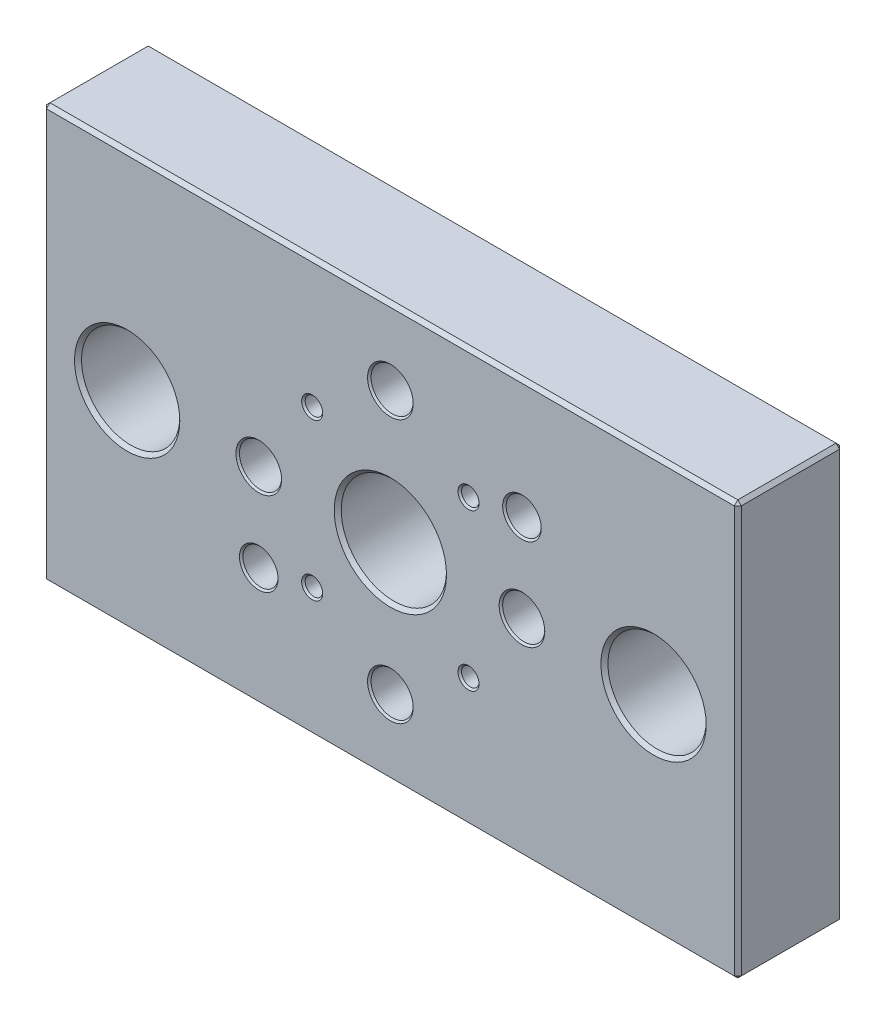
ISO-10303-21;
HEADER;
FILE_DESCRIPTION(('STEP AP214'),'2;1');
FILE_NAME('part.step','',(''),(''),'','','');
FILE_SCHEMA(('AUTOMOTIVE_DESIGN { 1 0 10303 214 1 1 1 1 }'));
ENDSEC;
DATA;
#1=APPLICATION_CONTEXT('core data for automotive mechanical design processes');
#2=APPLICATION_PROTOCOL_DEFINITION('international standard','automotive_design',2000,#1);
#3=PRODUCT_CONTEXT('',#1,'mechanical');
#4=PRODUCT('Part','Part','',(#3));
#5=PRODUCT_RELATED_PRODUCT_CATEGORY('part','',(#4));
#6=PRODUCT_DEFINITION_FORMATION('','',#4);
#7=PRODUCT_DEFINITION_CONTEXT('part definition',#1,'design');
#8=PRODUCT_DEFINITION('design','',#6,#7);
#9=PRODUCT_DEFINITION_SHAPE('','',#8);
#10=(LENGTH_UNIT() NAMED_UNIT(*) SI_UNIT(.MILLI.,.METRE.));
#11=(NAMED_UNIT(*) PLANE_ANGLE_UNIT() SI_UNIT($,.RADIAN.));
#12=(NAMED_UNIT(*) SI_UNIT($,.STERADIAN.) SOLID_ANGLE_UNIT());
#13=UNCERTAINTY_MEASURE_WITH_UNIT(LENGTH_MEASURE(1.E-05),#10,'distance_accuracy_value','');
#14=(GEOMETRIC_REPRESENTATION_CONTEXT(3) GLOBAL_UNCERTAINTY_ASSIGNED_CONTEXT((#13)) GLOBAL_UNIT_ASSIGNED_CONTEXT((#10,
#11,#12)) REPRESENTATION_CONTEXT('',''));
#15=CARTESIAN_POINT('',(0.,0.,0.));
#16=DIRECTION('',(0.,0.,1.));
#17=DIRECTION('',(1.,0.,0.));
#18=AXIS2_PLACEMENT_3D('',#15,#16,#17);
#19=CARTESIAN_POINT('',(-37.5,0.,30.));
#20=DIRECTION('',(0.,0.,-1.));
#21=DIRECTION('',(-1.,0.,0.));
#22=AXIS2_PLACEMENT_3D('',#19,#20,#21);
#23=CYLINDRICAL_SURFACE('',#22,3.25);
#24=CARTESIAN_POINT('',(-37.5,0.,0.500000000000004));
#25=DIRECTION('',(0.,0.,1.));
#26=DIRECTION('',(1.,0.,0.));
#27=AXIS2_PLACEMENT_3D('',#24,#25,#26);
#28=CIRCLE('',#27,3.25);
#29=CARTESIAN_POINT('',(-34.25,0.,0.500000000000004));
#30=VERTEX_POINT('',#29);
#31=EDGE_CURVE('E11',#30,#30,#28,.F.);
#32=ORIENTED_EDGE('',*,*,#31,.T.);
#33=EDGE_LOOP('',(#32));
#34=FACE_BOUND('',#33,.T.);
#35=CARTESIAN_POINT('',(-37.5,0.,10.));
#36=DIRECTION('',(0.,0.,1.));
#37=DIRECTION('',(1.,0.,0.));
#38=AXIS2_PLACEMENT_3D('',#35,#36,#37);
#39=CIRCLE('',#38,3.25);
#40=CARTESIAN_POINT('',(-34.25,0.,10.));
#41=VERTEX_POINT('',#40);
#42=EDGE_CURVE('E178',#41,#41,#39,.T.);
#43=ORIENTED_EDGE('',*,*,#42,.T.);
#44=EDGE_LOOP('',(#43));
#45=FACE_BOUND('',#44,.T.);
#46=ADVANCED_FACE('F43',(#34,#45),#23,.F.);
#47=CARTESIAN_POINT('',(0.,-37.5,30.));
#48=DIRECTION('',(0.,0.,-1.));
#49=DIRECTION('',(-1.,0.,0.));
#50=AXIS2_PLACEMENT_3D('',#47,#48,#49);
#51=CYLINDRICAL_SURFACE('',#50,3.25);
#52=CARTESIAN_POINT('',(0.,-37.5,0.500000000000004));
#53=DIRECTION('',(0.,0.,1.));
#54=DIRECTION('',(1.,0.,0.));
#55=AXIS2_PLACEMENT_3D('',#52,#53,#54);
#56=CIRCLE('',#55,3.25);
#57=CARTESIAN_POINT('',(3.25,-37.5,0.500000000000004));
#58=VERTEX_POINT('',#57);
#59=EDGE_CURVE('E51',#58,#58,#56,.F.);
#60=ORIENTED_EDGE('',*,*,#59,.T.);
#61=EDGE_LOOP('',(#60));
#62=FACE_BOUND('',#61,.T.);
#63=CARTESIAN_POINT('',(0.,-37.5,10.));
#64=DIRECTION('',(0.,0.,1.));
#65=DIRECTION('',(1.,0.,0.));
#66=AXIS2_PLACEMENT_3D('',#63,#64,#65);
#67=CIRCLE('',#66,3.25);
#68=CARTESIAN_POINT('',(3.25,-37.5,10.));
#69=VERTEX_POINT('',#68);
#70=EDGE_CURVE('E183',#69,#69,#67,.T.);
#71=ORIENTED_EDGE('',*,*,#70,.T.);
#72=EDGE_LOOP('',(#71));
#73=FACE_BOUND('',#72,.T.);
#74=ADVANCED_FACE('F468',(#62,#73),#51,.F.);
#75=CARTESIAN_POINT('',(37.5,0.,30.));
#76=DIRECTION('',(0.,0.,-1.));
#77=DIRECTION('',(-1.,0.,0.));
#78=AXIS2_PLACEMENT_3D('',#75,#76,#77);
#79=CYLINDRICAL_SURFACE('',#78,3.25);
#80=CARTESIAN_POINT('',(37.5,0.,0.500000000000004));
#81=DIRECTION('',(0.,0.,1.));
#82=DIRECTION('',(1.,0.,0.));
#83=AXIS2_PLACEMENT_3D('',#80,#81,#82);
#84=CIRCLE('',#83,3.25);
#85=CARTESIAN_POINT('',(40.75,0.,0.500000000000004));
#86=VERTEX_POINT('',#85);
#87=EDGE_CURVE('E463',#86,#86,#84,.F.);
#88=ORIENTED_EDGE('',*,*,#87,.T.);
#89=EDGE_LOOP('',(#88));
#90=FACE_BOUND('',#89,.T.);
#91=CARTESIAN_POINT('',(37.5,0.,10.));
#92=DIRECTION('',(0.,0.,1.));
#93=DIRECTION('',(1.,0.,0.));
#94=AXIS2_PLACEMENT_3D('',#91,#92,#93);
#95=CIRCLE('',#94,3.25);
#96=CARTESIAN_POINT('',(40.75,0.,10.));
#97=VERTEX_POINT('',#96);
#98=EDGE_CURVE('E187',#97,#97,#95,.T.);
#99=ORIENTED_EDGE('',*,*,#98,.T.);
#100=EDGE_LOOP('',(#99));
#101=FACE_BOUND('',#100,.T.);
#102=ADVANCED_FACE('F521',(#90,#101),#79,.F.);
#103=CARTESIAN_POINT('',(0.,37.5,30.));
#104=DIRECTION('',(0.,0.,-1.));
#105=DIRECTION('',(-1.,0.,0.));
#106=AXIS2_PLACEMENT_3D('',#103,#104,#105);
#107=CYLINDRICAL_SURFACE('',#106,3.25);
#108=CARTESIAN_POINT('',(0.,37.5,0.500000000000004));
#109=DIRECTION('',(0.,0.,1.));
#110=DIRECTION('',(1.,0.,0.));
#111=AXIS2_PLACEMENT_3D('',#108,#109,#110);
#112=CIRCLE('',#111,3.25);
#113=CARTESIAN_POINT('',(3.25,37.5,0.500000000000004));
#114=VERTEX_POINT('',#113);
#115=EDGE_CURVE('E460',#114,#114,#112,.F.);
#116=ORIENTED_EDGE('',*,*,#115,.T.);
#117=EDGE_LOOP('',(#116));
#118=FACE_BOUND('',#117,.T.);
#119=CARTESIAN_POINT('',(0.,37.5,10.));
#120=DIRECTION('',(0.,0.,1.));
#121=DIRECTION('',(1.,0.,0.));
#122=AXIS2_PLACEMENT_3D('',#119,#120,#121);
#123=CIRCLE('',#122,3.25);
#124=CARTESIAN_POINT('',(3.25,37.5,10.));
#125=VERTEX_POINT('',#124);
#126=EDGE_CURVE('E191',#125,#125,#123,.T.);
#127=ORIENTED_EDGE('',*,*,#126,.T.);
#128=EDGE_LOOP('',(#127));
#129=FACE_BOUND('',#128,.T.);
#130=ADVANCED_FACE('F527',(#118,#129),#107,.F.);
#131=CARTESIAN_POINT('',(-99.,59.,30.));
#132=DIRECTION('',(0.,0.,1.));
#133=DIRECTION('',(1.,0.,0.));
#134=AXIS2_PLACEMENT_3D('',#131,#132,#133);
#135=PLANE('',#134);
#136=CARTESIAN_POINT('',(-22.2738636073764,-22.2738636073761,30.));
#137=DIRECTION('',(0.,0.,1.));
#138=DIRECTION('',(1.,0.,0.));
#139=AXIS2_PLACEMENT_3D('',#136,#137,#138);
#140=CIRCLE('',#139,3.);
#141=CARTESIAN_POINT('',(-19.2738636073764,-22.2738636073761,30.));
#142=VERTEX_POINT('',#141);
#143=EDGE_CURVE('E433',#142,#142,#140,.F.);
#144=ORIENTED_EDGE('',*,*,#143,.T.);
#145=EDGE_LOOP('',(#144));
#146=FACE_BOUND('',#145,.T.);
#147=CARTESIAN_POINT('',(22.2738636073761,-22.2738636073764,30.));
#148=DIRECTION('',(0.,0.,1.));
#149=DIRECTION('',(1.,0.,0.));
#150=AXIS2_PLACEMENT_3D('',#147,#148,#149);
#151=CIRCLE('',#150,3.);
#152=CARTESIAN_POINT('',(25.2738636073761,-22.2738636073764,30.));
#153=VERTEX_POINT('',#152);
#154=EDGE_CURVE('E430',#153,#153,#151,.F.);
#155=ORIENTED_EDGE('',*,*,#154,.T.);
#156=EDGE_LOOP('',(#155));
#157=FACE_BOUND('',#156,.T.);
#158=CARTESIAN_POINT('',(22.2738636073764,22.2738636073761,30.));
#159=DIRECTION('',(0.,0.,1.));
#160=DIRECTION('',(1.,0.,0.));
#161=AXIS2_PLACEMENT_3D('',#158,#159,#160);
#162=CIRCLE('',#161,3.);
#163=CARTESIAN_POINT('',(25.2738636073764,22.2738636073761,30.));
#164=VERTEX_POINT('',#163);
#165=EDGE_CURVE('E427',#164,#164,#162,.F.);
#166=ORIENTED_EDGE('',*,*,#165,.T.);
#167=EDGE_LOOP('',(#166));
#168=FACE_BOUND('',#167,.T.);
#169=CARTESIAN_POINT('',(-22.2738636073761,22.2738636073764,30.));
#170=DIRECTION('',(0.,0.,1.));
#171=DIRECTION('',(1.,0.,0.));
#172=AXIS2_PLACEMENT_3D('',#169,#170,#171);
#173=CIRCLE('',#172,3.);
#174=CARTESIAN_POINT('',(-19.2738636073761,22.2738636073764,30.));
#175=VERTEX_POINT('',#174);
#176=EDGE_CURVE('E424',#175,#175,#173,.F.);
#177=ORIENTED_EDGE('',*,*,#176,.T.);
#178=EDGE_LOOP('',(#177));
#179=FACE_BOUND('',#178,.T.);
#180=CARTESIAN_POINT('',(-37.5,0.,30.));
#181=DIRECTION('',(0.,0.,1.));
#182=DIRECTION('',(1.,0.,0.));
#183=AXIS2_PLACEMENT_3D('',#180,#181,#182);
#184=CIRCLE('',#183,6.5);
#185=CARTESIAN_POINT('',(-31.,0.,30.));
#186=VERTEX_POINT('',#185);
#187=EDGE_CURVE('E421',#186,#186,#184,.F.);
#188=ORIENTED_EDGE('',*,*,#187,.T.);
#189=EDGE_LOOP('',(#188));
#190=FACE_BOUND('',#189,.T.);
#191=CARTESIAN_POINT('',(0.,37.5,30.));
#192=DIRECTION('',(0.,0.,1.));
#193=DIRECTION('',(1.,0.,0.));
#194=AXIS2_PLACEMENT_3D('',#191,#192,#193);
#195=CIRCLE('',#194,6.5);
#196=CARTESIAN_POINT('',(6.5,37.5,30.));
#197=VERTEX_POINT('',#196);
#198=EDGE_CURVE('E418',#197,#197,#195,.F.);
#199=ORIENTED_EDGE('',*,*,#198,.T.);
#200=EDGE_LOOP('',(#199));
#201=FACE_BOUND('',#200,.T.);
#202=CARTESIAN_POINT('',(37.5,25.,30.));
#203=DIRECTION('',(0.,0.,1.));
#204=DIRECTION('',(1.,0.,0.));
#205=AXIS2_PLACEMENT_3D('',#202,#203,#204);
#206=CIRCLE('',#205,5.5);
#207=CARTESIAN_POINT('',(43.,25.,30.));
#208=VERTEX_POINT('',#207);
#209=EDGE_CURVE('E415',#208,#208,#206,.F.);
#210=ORIENTED_EDGE('',*,*,#209,.T.);
#211=EDGE_LOOP('',(#210));
#212=FACE_BOUND('',#211,.T.);
#213=CARTESIAN_POINT('',(-37.5,-25.,30.));
#214=DIRECTION('',(0.,0.,1.));
#215=DIRECTION('',(1.,0.,0.));
#216=AXIS2_PLACEMENT_3D('',#213,#214,#215);
#217=CIRCLE('',#216,5.5);
#218=CARTESIAN_POINT('',(-32.,-25.,30.));
#219=VERTEX_POINT('',#218);
#220=EDGE_CURVE('E412',#219,#219,#217,.F.);
#221=ORIENTED_EDGE('',*,*,#220,.T.);
#222=EDGE_LOOP('',(#221));
#223=FACE_BOUND('',#222,.T.);
#224=CARTESIAN_POINT('',(0.,-37.5,30.));
#225=DIRECTION('',(0.,0.,1.));
#226=DIRECTION('',(1.,0.,0.));
#227=AXIS2_PLACEMENT_3D('',#224,#225,#226);
#228=CIRCLE('',#227,6.5);
#229=CARTESIAN_POINT('',(6.5,-37.5,30.));
#230=VERTEX_POINT('',#229);
#231=EDGE_CURVE('E409',#230,#230,#228,.F.);
#232=ORIENTED_EDGE('',*,*,#231,.T.);
#233=EDGE_LOOP('',(#232));
#234=FACE_BOUND('',#233,.T.);
#235=CARTESIAN_POINT('',(37.5,0.,30.));
#236=DIRECTION('',(0.,0.,1.));
#237=DIRECTION('',(1.,0.,0.));
#238=AXIS2_PLACEMENT_3D('',#235,#236,#237);
#239=CIRCLE('',#238,6.5);
#240=CARTESIAN_POINT('',(44.,0.,30.));
#241=VERTEX_POINT('',#240);
#242=EDGE_CURVE('E406',#241,#241,#239,.F.);
#243=ORIENTED_EDGE('',*,*,#242,.T.);
#244=EDGE_LOOP('',(#243));
#245=FACE_BOUND('',#244,.T.);
#246=CARTESIAN_POINT('',(0.,0.,30.));
#247=DIRECTION('',(0.,0.,1.));
#248=DIRECTION('',(1.,0.,0.));
#249=AXIS2_PLACEMENT_3D('',#246,#247,#248);
#250=CIRCLE('',#249,16.);
#251=CARTESIAN_POINT('',(16.,0.,30.));
#252=VERTEX_POINT('',#251);
#253=EDGE_CURVE('E215',#252,#252,#250,.F.);
#254=ORIENTED_EDGE('',*,*,#253,.T.);
#255=EDGE_LOOP('',(#254));
#256=FACE_BOUND('',#255,.T.);
#257=DIRECTION('',(-1.,0.,0.));
#258=VECTOR('',#257,1.);
#259=CARTESIAN_POINT('',(-99.,58.,30.));
#260=LINE('',#259,#258);
#261=CARTESIAN_POINT('',(98.,58.,30.));
#262=VERTEX_POINT('',#261);
#263=CARTESIAN_POINT('',(-98.,58.,30.));
#264=VERTEX_POINT('',#263);
#265=EDGE_CURVE('E208',#262,#264,#260,.T.);
#266=ORIENTED_EDGE('',*,*,#265,.T.);
#267=DIRECTION('',(0.,-1.,0.));
#268=VECTOR('',#267,1.);
#269=CARTESIAN_POINT('',(-98.,-59.,30.));
#270=LINE('',#269,#268);
#271=CARTESIAN_POINT('',(-98.,-58.,30.));
#272=VERTEX_POINT('',#271);
#273=EDGE_CURVE('E213',#264,#272,#270,.T.);
#274=ORIENTED_EDGE('',*,*,#273,.T.);
#275=DIRECTION('',(1.,0.,0.));
#276=VECTOR('',#275,1.);
#277=CARTESIAN_POINT('',(99.,-58.,30.));
#278=LINE('',#277,#276);
#279=CARTESIAN_POINT('',(98.,-58.,30.));
#280=VERTEX_POINT('',#279);
#281=EDGE_CURVE('E210',#272,#280,#278,.T.);
#282=ORIENTED_EDGE('',*,*,#281,.T.);
#283=DIRECTION('',(0.,1.,0.));
#284=VECTOR('',#283,1.);
#285=CARTESIAN_POINT('',(98.,59.,30.));
#286=LINE('',#285,#284);
#287=EDGE_CURVE('E206',#280,#262,#286,.T.);
#288=ORIENTED_EDGE('',*,*,#287,.T.);
#289=EDGE_LOOP('',(#266,#274,#282,#288));
#290=FACE_BOUND('',#289,.T.);
#291=CARTESIAN_POINT('',(-75.,0.,30.));
#292=DIRECTION('',(0.,0.,1.));
#293=DIRECTION('',(1.,0.,0.));
#294=AXIS2_PLACEMENT_3D('',#291,#292,#293);
#295=CIRCLE('',#294,15.);
#296=CARTESIAN_POINT('',(-60.,0.,30.));
#297=VERTEX_POINT('',#296);
#298=EDGE_CURVE('E203',#297,#297,#295,.F.);
#299=ORIENTED_EDGE('',*,*,#298,.T.);
#300=EDGE_LOOP('',(#299));
#301=FACE_BOUND('',#300,.T.);
#302=CARTESIAN_POINT('',(75.,0.,30.));
#303=DIRECTION('',(0.,0.,1.));
#304=DIRECTION('',(1.,0.,0.));
#305=AXIS2_PLACEMENT_3D('',#302,#303,#304);
#306=CIRCLE('',#305,15.);
#307=CARTESIAN_POINT('',(90.,0.,30.));
#308=VERTEX_POINT('',#307);
#309=EDGE_CURVE('E194',#308,#308,#306,.F.);
#310=ORIENTED_EDGE('',*,*,#309,.T.);
#311=EDGE_LOOP('',(#310));
#312=FACE_BOUND('',#311,.T.);
#313=ADVANCED_FACE('F483',(#146,#157,#168,#179,#190,#201,#212,#223,#234,#245,#256,#290,#301,
#312),#135,.T.);
#314=CARTESIAN_POINT('',(-99.,59.,0.));
#315=DIRECTION('',(0.,0.,1.));
#316=DIRECTION('',(1.,0.,0.));
#317=AXIS2_PLACEMENT_3D('',#314,#315,#316);
#318=PLANE('',#317);
#319=CARTESIAN_POINT('',(-75.,20.5,0.));
#320=DIRECTION('',(0.,0.,-1.));
#321=DIRECTION('',(-1.,0.,0.));
#322=AXIS2_PLACEMENT_3D('',#319,#320,#321);
#323=CIRCLE('',#322,1.24999999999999);
#324=CARTESIAN_POINT('',(-76.25,20.5,0.));
#325=VERTEX_POINT('',#324);
#326=EDGE_CURVE('E151',#325,#325,#323,.T.);
#327=ORIENTED_EDGE('',*,*,#326,.F.);
#328=EDGE_LOOP('',(#327));
#329=FACE_BOUND('',#328,.T.);
#330=CARTESIAN_POINT('',(-75.,-20.5,0.));
#331=DIRECTION('',(0.,0.,-1.));
#332=DIRECTION('',(-1.,0.,0.));
#333=AXIS2_PLACEMENT_3D('',#330,#331,#332);
#334=CIRCLE('',#333,1.24999999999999);
#335=CARTESIAN_POINT('',(-76.25,-20.5,0.));
#336=VERTEX_POINT('',#335);
#337=EDGE_CURVE('E159',#336,#336,#334,.T.);
#338=ORIENTED_EDGE('',*,*,#337,.F.);
#339=EDGE_LOOP('',(#338));
#340=FACE_BOUND('',#339,.T.);
#341=CARTESIAN_POINT('',(75.,-20.5,0.));
#342=DIRECTION('',(0.,0.,-1.));
#343=DIRECTION('',(-1.,0.,0.));
#344=AXIS2_PLACEMENT_3D('',#341,#342,#343);
#345=CIRCLE('',#344,1.24999999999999);
#346=CARTESIAN_POINT('',(73.75,-20.5,0.));
#347=VERTEX_POINT('',#346);
#348=EDGE_CURVE('E165',#347,#347,#345,.T.);
#349=ORIENTED_EDGE('',*,*,#348,.F.);
#350=EDGE_LOOP('',(#349));
#351=FACE_BOUND('',#350,.T.);
#352=CARTESIAN_POINT('',(75.,20.5,0.));
#353=DIRECTION('',(0.,0.,-1.));
#354=DIRECTION('',(-1.,0.,0.));
#355=AXIS2_PLACEMENT_3D('',#352,#353,#354);
#356=CIRCLE('',#355,1.24999999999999);
#357=CARTESIAN_POINT('',(73.75,20.5,0.));
#358=VERTEX_POINT('',#357);
#359=EDGE_CURVE('E171',#358,#358,#356,.T.);
#360=ORIENTED_EDGE('',*,*,#359,.F.);
#361=EDGE_LOOP('',(#360));
#362=FACE_BOUND('',#361,.T.);
#363=CARTESIAN_POINT('',(22.2738636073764,22.2738636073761,0.));
#364=DIRECTION('',(0.,0.,1.));
#365=DIRECTION('',(1.,0.,0.));
#366=AXIS2_PLACEMENT_3D('',#363,#364,#365);
#367=CIRCLE('',#366,3.00000000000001);
#368=CARTESIAN_POINT('',(25.2738636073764,22.2738636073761,0.));
#369=VERTEX_POINT('',#368);
#370=EDGE_CURVE('E379',#369,#369,#367,.T.);
#371=ORIENTED_EDGE('',*,*,#370,.T.);
#372=EDGE_LOOP('',(#371));
#373=FACE_BOUND('',#372,.T.);
#374=CARTESIAN_POINT('',(22.2738636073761,-22.2738636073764,0.));
#375=DIRECTION('',(0.,0.,1.));
#376=DIRECTION('',(1.,0.,0.));
#377=AXIS2_PLACEMENT_3D('',#374,#375,#376);
#378=CIRCLE('',#377,3.00000000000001);
#379=CARTESIAN_POINT('',(25.2738636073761,-22.2738636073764,0.));
#380=VERTEX_POINT('',#379);
#381=EDGE_CURVE('E376',#380,#380,#378,.T.);
#382=ORIENTED_EDGE('',*,*,#381,.T.);
#383=EDGE_LOOP('',(#382));
#384=FACE_BOUND('',#383,.T.);
#385=CARTESIAN_POINT('',(-22.2738636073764,-22.2738636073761,0.));
#386=DIRECTION('',(0.,0.,1.));
#387=DIRECTION('',(1.,0.,0.));
#388=AXIS2_PLACEMENT_3D('',#385,#386,#387);
#389=CIRCLE('',#388,3.00000000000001);
#390=CARTESIAN_POINT('',(-19.2738636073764,-22.2738636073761,0.));
#391=VERTEX_POINT('',#390);
#392=EDGE_CURVE('E373',#391,#391,#389,.T.);
#393=ORIENTED_EDGE('',*,*,#392,.T.);
#394=EDGE_LOOP('',(#393));
#395=FACE_BOUND('',#394,.T.);
#396=CARTESIAN_POINT('',(-22.2738636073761,22.2738636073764,0.));
#397=DIRECTION('',(0.,0.,1.));
#398=DIRECTION('',(1.,0.,0.));
#399=AXIS2_PLACEMENT_3D('',#396,#397,#398);
#400=CIRCLE('',#399,3.00000000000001);
#401=CARTESIAN_POINT('',(-19.2738636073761,22.2738636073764,0.));
#402=VERTEX_POINT('',#401);
#403=EDGE_CURVE('E370',#402,#402,#400,.T.);
#404=ORIENTED_EDGE('',*,*,#403,.T.);
#405=EDGE_LOOP('',(#404));
#406=FACE_BOUND('',#405,.T.);
#407=CARTESIAN_POINT('',(0.,37.5,0.));
#408=DIRECTION('',(0.,0.,1.));
#409=DIRECTION('',(1.,0.,0.));
#410=AXIS2_PLACEMENT_3D('',#407,#408,#409);
#411=CIRCLE('',#410,3.75000000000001);
#412=CARTESIAN_POINT('',(3.75000000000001,37.5,0.));
#413=VERTEX_POINT('',#412);
#414=EDGE_CURVE('E367',#413,#413,#411,.T.);
#415=ORIENTED_EDGE('',*,*,#414,.T.);
#416=EDGE_LOOP('',(#415));
#417=FACE_BOUND('',#416,.T.);
#418=CARTESIAN_POINT('',(37.5,25.,0.));
#419=DIRECTION('',(0.,0.,1.));
#420=DIRECTION('',(1.,0.,0.));
#421=AXIS2_PLACEMENT_3D('',#418,#419,#420);
#422=CIRCLE('',#421,5.50000000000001);
#423=CARTESIAN_POINT('',(43.,25.,0.));
#424=VERTEX_POINT('',#423);
#425=EDGE_CURVE('E364',#424,#424,#422,.T.);
#426=ORIENTED_EDGE('',*,*,#425,.T.);
#427=EDGE_LOOP('',(#426));
#428=FACE_BOUND('',#427,.T.);
#429=CARTESIAN_POINT('',(37.5,0.,0.));
#430=DIRECTION('',(0.,0.,1.));
#431=DIRECTION('',(1.,0.,0.));
#432=AXIS2_PLACEMENT_3D('',#429,#430,#431);
#433=CIRCLE('',#432,3.75000000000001);
#434=CARTESIAN_POINT('',(41.25,0.,0.));
#435=VERTEX_POINT('',#434);
#436=EDGE_CURVE('E361',#435,#435,#433,.T.);
#437=ORIENTED_EDGE('',*,*,#436,.T.);
#438=EDGE_LOOP('',(#437));
#439=FACE_BOUND('',#438,.T.);
#440=CARTESIAN_POINT('',(0.,-37.5,0.));
#441=DIRECTION('',(0.,0.,1.));
#442=DIRECTION('',(1.,0.,0.));
#443=AXIS2_PLACEMENT_3D('',#440,#441,#442);
#444=CIRCLE('',#443,3.75000000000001);
#445=CARTESIAN_POINT('',(3.75000000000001,-37.5,0.));
#446=VERTEX_POINT('',#445);
#447=EDGE_CURVE('E358',#446,#446,#444,.T.);
#448=ORIENTED_EDGE('',*,*,#447,.T.);
#449=EDGE_LOOP('',(#448));
#450=FACE_BOUND('',#449,.T.);
#451=CARTESIAN_POINT('',(-37.5,-25.,0.));
#452=DIRECTION('',(0.,0.,1.));
#453=DIRECTION('',(1.,0.,0.));
#454=AXIS2_PLACEMENT_3D('',#451,#452,#453);
#455=CIRCLE('',#454,5.50000000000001);
#456=CARTESIAN_POINT('',(-32.,-25.,0.));
#457=VERTEX_POINT('',#456);
#458=EDGE_CURVE('E355',#457,#457,#455,.T.);
#459=ORIENTED_EDGE('',*,*,#458,.T.);
#460=EDGE_LOOP('',(#459));
#461=FACE_BOUND('',#460,.T.);
#462=CARTESIAN_POINT('',(-37.5,0.,0.));
#463=DIRECTION('',(0.,0.,1.));
#464=DIRECTION('',(1.,0.,0.));
#465=AXIS2_PLACEMENT_3D('',#462,#463,#464);
#466=CIRCLE('',#465,3.75000000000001);
#467=CARTESIAN_POINT('',(-33.75,0.,0.));
#468=VERTEX_POINT('',#467);
#469=EDGE_CURVE('E287',#468,#468,#466,.T.);
#470=ORIENTED_EDGE('',*,*,#469,.T.);
#471=EDGE_LOOP('',(#470));
#472=FACE_BOUND('',#471,.T.);
#473=CARTESIAN_POINT('',(0.,0.,0.));
#474=DIRECTION('',(0.,0.,1.));
#475=DIRECTION('',(1.,0.,0.));
#476=AXIS2_PLACEMENT_3D('',#473,#474,#475);
#477=CIRCLE('',#476,16.);
#478=CARTESIAN_POINT('',(16.,0.,0.));
#479=VERTEX_POINT('',#478);
#480=EDGE_CURVE('E242',#479,#479,#477,.T.);
#481=ORIENTED_EDGE('',*,*,#480,.T.);
#482=EDGE_LOOP('',(#481));
#483=FACE_BOUND('',#482,.T.);
#484=DIRECTION('',(-1.,0.,0.));
#485=VECTOR('',#484,1.);
#486=CARTESIAN_POINT('',(-99.,-58.,0.));
#487=LINE('',#486,#485);
#488=CARTESIAN_POINT('',(98.,-58.,0.));
#489=VERTEX_POINT('',#488);
#490=CARTESIAN_POINT('',(-98.,-58.,0.));
#491=VERTEX_POINT('',#490);
#492=EDGE_CURVE('E237',#489,#491,#487,.T.);
#493=ORIENTED_EDGE('',*,*,#492,.T.);
#494=DIRECTION('',(0.,1.,0.));
#495=VECTOR('',#494,1.);
#496=CARTESIAN_POINT('',(-98.,59.,0.));
#497=LINE('',#496,#495);
#498=CARTESIAN_POINT('',(-98.,58.,0.));
#499=VERTEX_POINT('',#498);
#500=EDGE_CURVE('E240',#491,#499,#497,.T.);
#501=ORIENTED_EDGE('',*,*,#500,.T.);
#502=DIRECTION('',(1.,0.,0.));
#503=VECTOR('',#502,1.);
#504=CARTESIAN_POINT('',(-99.,58.,0.));
#505=LINE('',#504,#503);
#506=CARTESIAN_POINT('',(98.,58.,0.));
#507=VERTEX_POINT('',#506);
#508=EDGE_CURVE('E235',#499,#507,#505,.T.);
#509=ORIENTED_EDGE('',*,*,#508,.T.);
#510=DIRECTION('',(0.,-1.,0.));
#511=VECTOR('',#510,1.);
#512=CARTESIAN_POINT('',(98.,59.,0.));
#513=LINE('',#512,#511);
#514=EDGE_CURVE('E233',#507,#489,#513,.T.);
#515=ORIENTED_EDGE('',*,*,#514,.T.);
#516=EDGE_LOOP('',(#493,#501,#509,#515));
#517=FACE_BOUND('',#516,.T.);
#518=CARTESIAN_POINT('',(-75.,0.,0.));
#519=DIRECTION('',(0.,0.,1.));
#520=DIRECTION('',(1.,0.,0.));
#521=AXIS2_PLACEMENT_3D('',#518,#519,#520);
#522=CIRCLE('',#521,15.);
#523=CARTESIAN_POINT('',(-60.,0.,0.));
#524=VERTEX_POINT('',#523);
#525=EDGE_CURVE('E230',#524,#524,#522,.T.);
#526=ORIENTED_EDGE('',*,*,#525,.T.);
#527=EDGE_LOOP('',(#526));
#528=FACE_BOUND('',#527,.T.);
#529=CARTESIAN_POINT('',(75.,0.,0.));
#530=DIRECTION('',(0.,0.,1.));
#531=DIRECTION('',(1.,0.,0.));
#532=AXIS2_PLACEMENT_3D('',#529,#530,#531);
#533=CIRCLE('',#532,15.);
#534=CARTESIAN_POINT('',(90.,0.,0.));
#535=VERTEX_POINT('',#534);
#536=EDGE_CURVE('E227',#535,#535,#533,.T.);
#537=ORIENTED_EDGE('',*,*,#536,.T.);
#538=EDGE_LOOP('',(#537));
#539=FACE_BOUND('',#538,.T.);
#540=ADVANCED_FACE('F479',(#329,#340,#351,#362,#373,#384,#395,#406,#417,#428,#439,#450,#461,
#472,#483,#517,#528,#539),#318,.F.);
#541=CARTESIAN_POINT('',(99.,59.,30.));
#542=DIRECTION('',(0.,-1.,0.));
#543=DIRECTION('',(1.,0.,0.));
#544=AXIS2_PLACEMENT_3D('',#541,#542,#543);
#545=PLANE('',#544);
#546=DIRECTION('',(-1.,0.,0.));
#547=VECTOR('',#546,1.);
#548=CARTESIAN_POINT('',(99.,59.,1.00000000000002));
#549=LINE('',#548,#547);
#550=CARTESIAN_POINT('',(98.,59.,1.00000000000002));
#551=VERTEX_POINT('',#550);
#552=CARTESIAN_POINT('',(-98.,59.,1.00000000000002));
#553=VERTEX_POINT('',#552);
#554=EDGE_CURVE('E247',#551,#553,#549,.T.);
#555=ORIENTED_EDGE('',*,*,#554,.T.);
#556=DIRECTION('',(0.,0.,1.));
#557=VECTOR('',#556,1.);
#558=CARTESIAN_POINT('',(-98.,59.,30.));
#559=LINE('',#558,#557);
#560=CARTESIAN_POINT('',(-98.,59.,29.));
#561=VERTEX_POINT('',#560);
#562=EDGE_CURVE('E252',#553,#561,#559,.T.);
#563=ORIENTED_EDGE('',*,*,#562,.T.);
#564=DIRECTION('',(1.,0.,0.));
#565=VECTOR('',#564,1.);
#566=CARTESIAN_POINT('',(99.,59.,29.));
#567=LINE('',#566,#565);
#568=CARTESIAN_POINT('',(98.,59.,29.));
#569=VERTEX_POINT('',#568);
#570=EDGE_CURVE('E249',#561,#569,#567,.T.);
#571=ORIENTED_EDGE('',*,*,#570,.T.);
#572=DIRECTION('',(0.,0.,-1.));
#573=VECTOR('',#572,1.);
#574=CARTESIAN_POINT('',(98.,59.,30.));
#575=LINE('',#574,#573);
#576=EDGE_CURVE('E245',#569,#551,#575,.T.);
#577=ORIENTED_EDGE('',*,*,#576,.T.);
#578=EDGE_LOOP('',(#555,#563,#571,#577));
#579=FACE_BOUND('',#578,.T.);
#580=ADVANCED_FACE('F482',(#579),#545,.F.);
#581=CARTESIAN_POINT('',(-99.,59.,30.));
#582=DIRECTION('',(1.,0.,0.));
#583=DIRECTION('',(0.,0.,-1.));
#584=AXIS2_PLACEMENT_3D('',#581,#582,#583);
#585=PLANE('',#584);
#586=DIRECTION('',(0.,1.,0.));
#587=VECTOR('',#586,1.);
#588=CARTESIAN_POINT('',(-99.,59.,29.));
#589=LINE('',#588,#587);
#590=CARTESIAN_POINT('',(-99.,-58.,29.));
#591=VERTEX_POINT('',#590);
#592=CARTESIAN_POINT('',(-99.,58.,29.));
#593=VERTEX_POINT('',#592);
#594=EDGE_CURVE('E264',#591,#593,#589,.T.);
#595=ORIENTED_EDGE('',*,*,#594,.T.);
#596=DIRECTION('',(0.,0.,-1.));
#597=VECTOR('',#596,1.);
#598=CARTESIAN_POINT('',(-99.,58.,30.));
#599=LINE('',#598,#597);
#600=CARTESIAN_POINT('',(-99.,58.,1.00000000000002));
#601=VERTEX_POINT('',#600);
#602=EDGE_CURVE('E266',#593,#601,#599,.T.);
#603=ORIENTED_EDGE('',*,*,#602,.T.);
#604=DIRECTION('',(0.,-1.,0.));
#605=VECTOR('',#604,1.);
#606=CARTESIAN_POINT('',(-99.,59.,1.00000000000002));
#607=LINE('',#606,#605);
#608=CARTESIAN_POINT('',(-99.,-58.,1.00000000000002));
#609=VERTEX_POINT('',#608);
#610=EDGE_CURVE('E260',#601,#609,#607,.T.);
#611=ORIENTED_EDGE('',*,*,#610,.T.);
#612=DIRECTION('',(0.,0.,1.));
#613=VECTOR('',#612,1.);
#614=CARTESIAN_POINT('',(-99.,-58.,30.));
#615=LINE('',#614,#613);
#616=EDGE_CURVE('E262',#609,#591,#615,.T.);
#617=ORIENTED_EDGE('',*,*,#616,.T.);
#618=EDGE_LOOP('',(#595,#603,#611,#617));
#619=FACE_BOUND('',#618,.T.);
#620=ADVANCED_FACE('F557',(#619),#585,.F.);
#621=CARTESIAN_POINT('',(-99.,-59.,30.));
#622=DIRECTION('',(0.,1.,0.));
#623=DIRECTION('',(-1.,0.,0.));
#624=AXIS2_PLACEMENT_3D('',#621,#622,#623);
#625=PLANE('',#624);
#626=DIRECTION('',(-1.,0.,0.));
#627=VECTOR('',#626,1.);
#628=CARTESIAN_POINT('',(-99.,-59.,29.));
#629=LINE('',#628,#627);
#630=CARTESIAN_POINT('',(98.,-59.,29.));
#631=VERTEX_POINT('',#630);
#632=CARTESIAN_POINT('',(-98.,-59.,29.));
#633=VERTEX_POINT('',#632);
#634=EDGE_CURVE('E222',#631,#633,#629,.T.);
#635=ORIENTED_EDGE('',*,*,#634,.T.);
#636=DIRECTION('',(0.,0.,-1.));
#637=VECTOR('',#636,1.);
#638=CARTESIAN_POINT('',(-98.,-59.,30.));
#639=LINE('',#638,#637);
#640=CARTESIAN_POINT('',(-98.,-59.,1.00000000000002));
#641=VERTEX_POINT('',#640);
#642=EDGE_CURVE('E225',#633,#641,#639,.T.);
#643=ORIENTED_EDGE('',*,*,#642,.T.);
#644=DIRECTION('',(1.,0.,0.));
#645=VECTOR('',#644,1.);
#646=CARTESIAN_POINT('',(-99.,-59.,1.00000000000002));
#647=LINE('',#646,#645);
#648=CARTESIAN_POINT('',(98.,-59.,1.00000000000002));
#649=VERTEX_POINT('',#648);
#650=EDGE_CURVE('E220',#641,#649,#647,.T.);
#651=ORIENTED_EDGE('',*,*,#650,.T.);
#652=DIRECTION('',(0.,0.,1.));
#653=VECTOR('',#652,1.);
#654=CARTESIAN_POINT('',(98.,-59.,30.));
#655=LINE('',#654,#653);
#656=EDGE_CURVE('E218',#649,#631,#655,.T.);
#657=ORIENTED_EDGE('',*,*,#656,.T.);
#658=EDGE_LOOP('',(#635,#643,#651,#657));
#659=FACE_BOUND('',#658,.T.);
#660=ADVANCED_FACE('F554',(#659),#625,.F.);
#661=CARTESIAN_POINT('',(99.,-59.,30.));
#662=DIRECTION('',(-1.,0.,0.));
#663=DIRECTION('',(0.,0.,1.));
#664=AXIS2_PLACEMENT_3D('',#661,#662,#663);
#665=PLANE('',#664);
#666=DIRECTION('',(0.,-1.,0.));
#667=VECTOR('',#666,1.);
#668=CARTESIAN_POINT('',(99.,-59.,29.));
#669=LINE('',#668,#667);
#670=CARTESIAN_POINT('',(99.,58.,29.));
#671=VERTEX_POINT('',#670);
#672=CARTESIAN_POINT('',(99.,-58.,29.));
#673=VERTEX_POINT('',#672);
#674=EDGE_CURVE('E58',#671,#673,#669,.T.);
#675=ORIENTED_EDGE('',*,*,#674,.T.);
#676=DIRECTION('',(0.,0.,-1.));
#677=VECTOR('',#676,1.);
#678=CARTESIAN_POINT('',(99.,-58.,30.));
#679=LINE('',#678,#677);
#680=CARTESIAN_POINT('',(99.,-58.,1.00000000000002));
#681=VERTEX_POINT('',#680);
#682=EDGE_CURVE('E273',#673,#681,#679,.T.);
#683=ORIENTED_EDGE('',*,*,#682,.T.);
#684=DIRECTION('',(0.,1.,0.));
#685=VECTOR('',#684,1.);
#686=CARTESIAN_POINT('',(99.,-59.,1.00000000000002));
#687=LINE('',#686,#685);
#688=CARTESIAN_POINT('',(99.,58.,1.00000000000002));
#689=VERTEX_POINT('',#688);
#690=EDGE_CURVE('E269',#681,#689,#687,.T.);
#691=ORIENTED_EDGE('',*,*,#690,.T.);
#692=DIRECTION('',(0.,0.,1.));
#693=VECTOR('',#692,1.);
#694=CARTESIAN_POINT('',(99.,58.,30.));
#695=LINE('',#694,#693);
#696=EDGE_CURVE('E63',#689,#671,#695,.T.);
#697=ORIENTED_EDGE('',*,*,#696,.T.);
#698=EDGE_LOOP('',(#675,#683,#691,#697));
#699=FACE_BOUND('',#698,.T.);
#700=ADVANCED_FACE('F547',(#699),#665,.F.);
#701=CARTESIAN_POINT('',(75.,0.,30.));
#702=DIRECTION('',(0.,0.,-1.));
#703=DIRECTION('',(-1.,0.,0.));
#704=AXIS2_PLACEMENT_3D('',#701,#702,#703);
#705=CYLINDRICAL_SURFACE('',#704,14.);
#706=CARTESIAN_POINT('',(75.,0.,1.00000000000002));
#707=DIRECTION('',(0.,0.,1.));
#708=DIRECTION('',(1.,0.,0.));
#709=AXIS2_PLACEMENT_3D('',#706,#707,#708);
#710=CIRCLE('',#709,14.);
#711=CARTESIAN_POINT('',(89.,0.,1.00000000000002));
#712=VERTEX_POINT('',#711);
#713=EDGE_CURVE('E284',#712,#712,#710,.F.);
#714=ORIENTED_EDGE('',*,*,#713,.T.);
#715=EDGE_LOOP('',(#714));
#716=FACE_BOUND('',#715,.T.);
#717=CARTESIAN_POINT('',(75.,0.,29.));
#718=DIRECTION('',(0.,0.,1.));
#719=DIRECTION('',(1.,0.,0.));
#720=AXIS2_PLACEMENT_3D('',#717,#718,#719);
#721=CIRCLE('',#720,14.);
#722=CARTESIAN_POINT('',(89.,0.,29.));
#723=VERTEX_POINT('',#722);
#724=EDGE_CURVE('E281',#723,#723,#721,.T.);
#725=ORIENTED_EDGE('',*,*,#724,.T.);
#726=EDGE_LOOP('',(#725));
#727=FACE_BOUND('',#726,.T.);
#728=ADVANCED_FACE('F543',(#716,#727),#705,.F.);
#729=CARTESIAN_POINT('',(-75.,0.,30.));
#730=DIRECTION('',(0.,0.,-1.));
#731=DIRECTION('',(-1.,0.,0.));
#732=AXIS2_PLACEMENT_3D('',#729,#730,#731);
#733=CYLINDRICAL_SURFACE('',#732,14.);
#734=CARTESIAN_POINT('',(-75.,0.,1.00000000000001));
#735=DIRECTION('',(0.,0.,1.));
#736=DIRECTION('',(1.,0.,0.));
#737=AXIS2_PLACEMENT_3D('',#734,#735,#736);
#738=CIRCLE('',#737,14.);
#739=CARTESIAN_POINT('',(-61.,0.,1.00000000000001));
#740=VERTEX_POINT('',#739);
#741=EDGE_CURVE('E278',#740,#740,#738,.F.);
#742=ORIENTED_EDGE('',*,*,#741,.T.);
#743=EDGE_LOOP('',(#742));
#744=FACE_BOUND('',#743,.T.);
#745=CARTESIAN_POINT('',(-75.,0.,29.));
#746=DIRECTION('',(0.,0.,1.));
#747=DIRECTION('',(1.,0.,0.));
#748=AXIS2_PLACEMENT_3D('',#745,#746,#747);
#749=CIRCLE('',#748,14.);
#750=CARTESIAN_POINT('',(-61.,0.,29.));
#751=VERTEX_POINT('',#750);
#752=EDGE_CURVE('E275',#751,#751,#749,.T.);
#753=ORIENTED_EDGE('',*,*,#752,.T.);
#754=EDGE_LOOP('',(#753));
#755=FACE_BOUND('',#754,.T.);
#756=ADVANCED_FACE('F539',(#744,#755),#733,.F.);
#757=CARTESIAN_POINT('',(37.5,25.,30.));
#758=DIRECTION('',(0.,0.,-1.));
#759=DIRECTION('',(-1.,0.,0.));
#760=AXIS2_PLACEMENT_3D('',#757,#758,#759);
#761=CYLINDRICAL_SURFACE('',#760,5.);
#762=CARTESIAN_POINT('',(37.5,25.,29.5));
#763=DIRECTION('',(0.,0.,1.));
#764=DIRECTION('',(1.,0.,0.));
#765=AXIS2_PLACEMENT_3D('',#762,#763,#764);
#766=CIRCLE('',#765,5.);
#767=CARTESIAN_POINT('',(42.5,25.,29.5));
#768=VERTEX_POINT('',#767);
#769=EDGE_CURVE('E445',#768,#768,#766,.T.);
#770=ORIENTED_EDGE('',*,*,#769,.T.);
#771=EDGE_LOOP('',(#770));
#772=FACE_BOUND('',#771,.T.);
#773=CARTESIAN_POINT('',(37.5,25.,0.500000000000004));
#774=DIRECTION('',(0.,0.,1.));
#775=DIRECTION('',(1.,0.,0.));
#776=AXIS2_PLACEMENT_3D('',#773,#774,#775);
#777=CIRCLE('',#776,5.);
#778=CARTESIAN_POINT('',(42.5,25.,0.500000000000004));
#779=VERTEX_POINT('',#778);
#780=EDGE_CURVE('E442',#779,#779,#777,.F.);
#781=ORIENTED_EDGE('',*,*,#780,.T.);
#782=EDGE_LOOP('',(#781));
#783=FACE_BOUND('',#782,.T.);
#784=ADVANCED_FACE('F535',(#772,#783),#761,.F.);
#785=CARTESIAN_POINT('',(-37.5,-25.,30.));
#786=DIRECTION('',(0.,0.,-1.));
#787=DIRECTION('',(-1.,0.,0.));
#788=AXIS2_PLACEMENT_3D('',#785,#786,#787);
#789=CYLINDRICAL_SURFACE('',#788,5.);
#790=CARTESIAN_POINT('',(-37.5,-25.,29.5));
#791=DIRECTION('',(0.,0.,1.));
#792=DIRECTION('',(1.,0.,0.));
#793=AXIS2_PLACEMENT_3D('',#790,#791,#792);
#794=CIRCLE('',#793,5.);
#795=CARTESIAN_POINT('',(-32.5,-25.,29.5));
#796=VERTEX_POINT('',#795);
#797=EDGE_CURVE('E451',#796,#796,#794,.T.);
#798=ORIENTED_EDGE('',*,*,#797,.T.);
#799=EDGE_LOOP('',(#798));
#800=FACE_BOUND('',#799,.T.);
#801=CARTESIAN_POINT('',(-37.5,-25.,0.500000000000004));
#802=DIRECTION('',(0.,0.,1.));
#803=DIRECTION('',(1.,0.,0.));
#804=AXIS2_PLACEMENT_3D('',#801,#802,#803);
#805=CIRCLE('',#804,5.);
#806=CARTESIAN_POINT('',(-32.5,-25.,0.500000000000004));
#807=VERTEX_POINT('',#806);
#808=EDGE_CURVE('E448',#807,#807,#805,.F.);
#809=ORIENTED_EDGE('',*,*,#808,.T.);
#810=EDGE_LOOP('',(#809));
#811=FACE_BOUND('',#810,.T.);
#812=ADVANCED_FACE('F531',(#800,#811),#789,.F.);
#813=CARTESIAN_POINT('',(0.,0.,30.));
#814=DIRECTION('',(0.,0.,-1.));
#815=DIRECTION('',(-1.,0.,0.));
#816=AXIS2_PLACEMENT_3D('',#813,#814,#815);
#817=CYLINDRICAL_SURFACE('',#816,15.);
#818=CARTESIAN_POINT('',(0.,0.,1.00000000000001));
#819=DIRECTION('',(0.,0.,1.));
#820=DIRECTION('',(1.,0.,0.));
#821=AXIS2_PLACEMENT_3D('',#818,#819,#820);
#822=CIRCLE('',#821,15.);
#823=CARTESIAN_POINT('',(15.,0.,1.00000000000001));
#824=VERTEX_POINT('',#823);
#825=EDGE_CURVE('E257',#824,#824,#822,.F.);
#826=ORIENTED_EDGE('',*,*,#825,.T.);
#827=EDGE_LOOP('',(#826));
#828=FACE_BOUND('',#827,.T.);
#829=CARTESIAN_POINT('',(0.,0.,29.));
#830=DIRECTION('',(0.,0.,1.));
#831=DIRECTION('',(1.,0.,0.));
#832=AXIS2_PLACEMENT_3D('',#829,#830,#831);
#833=CIRCLE('',#832,15.);
#834=CARTESIAN_POINT('',(15.,0.,29.));
#835=VERTEX_POINT('',#834);
#836=EDGE_CURVE('E254',#835,#835,#833,.T.);
#837=ORIENTED_EDGE('',*,*,#836,.T.);
#838=EDGE_LOOP('',(#837));
#839=FACE_BOUND('',#838,.T.);
#840=ADVANCED_FACE('F534',(#828,#839),#817,.F.);
#841=CARTESIAN_POINT('',(-22.2738636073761,22.2738636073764,30.));
#842=DIRECTION('',(0.,0.,-1.));
#843=DIRECTION('',(-1.,0.,0.));
#844=AXIS2_PLACEMENT_3D('',#841,#842,#843);
#845=CYLINDRICAL_SURFACE('',#844,2.5);
#846=CARTESIAN_POINT('',(-22.2738636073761,22.2738636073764,0.500000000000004));
#847=DIRECTION('',(0.,0.,1.));
#848=DIRECTION('',(1.,0.,0.));
#849=AXIS2_PLACEMENT_3D('',#846,#847,#848);
#850=CIRCLE('',#849,2.5);
#851=CARTESIAN_POINT('',(-19.7738636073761,22.2738636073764,0.500000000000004));
#852=VERTEX_POINT('',#851);
#853=EDGE_CURVE('E403',#852,#852,#850,.F.);
#854=ORIENTED_EDGE('',*,*,#853,.T.);
#855=EDGE_LOOP('',(#854));
#856=FACE_BOUND('',#855,.T.);
#857=CARTESIAN_POINT('',(-22.2738636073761,22.2738636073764,29.5));
#858=DIRECTION('',(0.,0.,1.));
#859=DIRECTION('',(1.,0.,0.));
#860=AXIS2_PLACEMENT_3D('',#857,#858,#859);
#861=CIRCLE('',#860,2.5);
#862=CARTESIAN_POINT('',(-19.7738636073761,22.2738636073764,29.5));
#863=VERTEX_POINT('',#862);
#864=EDGE_CURVE('E400',#863,#863,#861,.T.);
#865=ORIENTED_EDGE('',*,*,#864,.T.);
#866=EDGE_LOOP('',(#865));
#867=FACE_BOUND('',#866,.T.);
#868=ADVANCED_FACE('F835',(#856,#867),#845,.F.);
#869=CARTESIAN_POINT('',(22.2738636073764,22.2738636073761,30.));
#870=DIRECTION('',(0.,0.,-1.));
#871=DIRECTION('',(-1.,0.,0.));
#872=AXIS2_PLACEMENT_3D('',#869,#870,#871);
#873=CYLINDRICAL_SURFACE('',#872,2.5);
#874=CARTESIAN_POINT('',(22.2738636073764,22.2738636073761,0.500000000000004));
#875=DIRECTION('',(0.,0.,1.));
#876=DIRECTION('',(1.,0.,0.));
#877=AXIS2_PLACEMENT_3D('',#874,#875,#876);
#878=CIRCLE('',#877,2.5);
#879=CARTESIAN_POINT('',(24.7738636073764,22.2738636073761,0.500000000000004));
#880=VERTEX_POINT('',#879);
#881=EDGE_CURVE('E385',#880,#880,#878,.F.);
#882=ORIENTED_EDGE('',*,*,#881,.T.);
#883=EDGE_LOOP('',(#882));
#884=FACE_BOUND('',#883,.T.);
#885=CARTESIAN_POINT('',(22.2738636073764,22.2738636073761,29.5));
#886=DIRECTION('',(0.,0.,1.));
#887=DIRECTION('',(1.,0.,0.));
#888=AXIS2_PLACEMENT_3D('',#885,#886,#887);
#889=CIRCLE('',#888,2.5);
#890=CARTESIAN_POINT('',(24.7738636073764,22.2738636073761,29.5));
#891=VERTEX_POINT('',#890);
#892=EDGE_CURVE('E382',#891,#891,#889,.T.);
#893=ORIENTED_EDGE('',*,*,#892,.T.);
#894=EDGE_LOOP('',(#893));
#895=FACE_BOUND('',#894,.T.);
#896=ADVANCED_FACE('F845',(#884,#895),#873,.F.);
#897=CARTESIAN_POINT('',(22.2738636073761,-22.2738636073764,30.));
#898=DIRECTION('',(0.,0.,-1.));
#899=DIRECTION('',(-1.,0.,0.));
#900=AXIS2_PLACEMENT_3D('',#897,#898,#899);
#901=CYLINDRICAL_SURFACE('',#900,2.5);
#902=CARTESIAN_POINT('',(22.2738636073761,-22.2738636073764,0.500000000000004));
#903=DIRECTION('',(0.,0.,1.));
#904=DIRECTION('',(1.,0.,0.));
#905=AXIS2_PLACEMENT_3D('',#902,#903,#904);
#906=CIRCLE('',#905,2.5);
#907=CARTESIAN_POINT('',(24.7738636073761,-22.2738636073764,0.500000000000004));
#908=VERTEX_POINT('',#907);
#909=EDGE_CURVE('E391',#908,#908,#906,.F.);
#910=ORIENTED_EDGE('',*,*,#909,.T.);
#911=EDGE_LOOP('',(#910));
#912=FACE_BOUND('',#911,.T.);
#913=CARTESIAN_POINT('',(22.2738636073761,-22.2738636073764,29.5));
#914=DIRECTION('',(0.,0.,1.));
#915=DIRECTION('',(1.,0.,0.));
#916=AXIS2_PLACEMENT_3D('',#913,#914,#915);
#917=CIRCLE('',#916,2.5);
#918=CARTESIAN_POINT('',(24.7738636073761,-22.2738636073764,29.5));
#919=VERTEX_POINT('',#918);
#920=EDGE_CURVE('E388',#919,#919,#917,.T.);
#921=ORIENTED_EDGE('',*,*,#920,.T.);
#922=EDGE_LOOP('',(#921));
#923=FACE_BOUND('',#922,.T.);
#924=ADVANCED_FACE('F856',(#912,#923),#901,.F.);
#925=CARTESIAN_POINT('',(-22.2738636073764,-22.2738636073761,30.));
#926=DIRECTION('',(0.,0.,-1.));
#927=DIRECTION('',(-1.,0.,0.));
#928=AXIS2_PLACEMENT_3D('',#925,#926,#927);
#929=CYLINDRICAL_SURFACE('',#928,2.5);
#930=CARTESIAN_POINT('',(-22.2738636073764,-22.2738636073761,0.500000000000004));
#931=DIRECTION('',(0.,0.,1.));
#932=DIRECTION('',(1.,0.,0.));
#933=AXIS2_PLACEMENT_3D('',#930,#931,#932);
#934=CIRCLE('',#933,2.5);
#935=CARTESIAN_POINT('',(-19.7738636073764,-22.2738636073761,0.500000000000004));
#936=VERTEX_POINT('',#935);
#937=EDGE_CURVE('E397',#936,#936,#934,.F.);
#938=ORIENTED_EDGE('',*,*,#937,.T.);
#939=EDGE_LOOP('',(#938));
#940=FACE_BOUND('',#939,.T.);
#941=CARTESIAN_POINT('',(-22.2738636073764,-22.2738636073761,29.5));
#942=DIRECTION('',(0.,0.,1.));
#943=DIRECTION('',(1.,0.,0.));
#944=AXIS2_PLACEMENT_3D('',#941,#942,#943);
#945=CIRCLE('',#944,2.5);
#946=CARTESIAN_POINT('',(-19.7738636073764,-22.2738636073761,29.5));
#947=VERTEX_POINT('',#946);
#948=EDGE_CURVE('E394',#947,#947,#945,.T.);
#949=ORIENTED_EDGE('',*,*,#948,.T.);
#950=EDGE_LOOP('',(#949));
#951=FACE_BOUND('',#950,.T.);
#952=ADVANCED_FACE('F691',(#940,#951),#929,.F.);
#953=CARTESIAN_POINT('',(0.,37.5,10.));
#954=DIRECTION('',(0.,0.,1.));
#955=DIRECTION('',(1.,0.,0.));
#956=AXIS2_PLACEMENT_3D('',#953,#954,#955);
#957=CYLINDRICAL_SURFACE('',#956,6.);
#958=CARTESIAN_POINT('',(0.,37.5,29.5));
#959=DIRECTION('',(0.,0.,1.));
#960=DIRECTION('',(1.,0.,0.));
#961=AXIS2_PLACEMENT_3D('',#958,#959,#960);
#962=CIRCLE('',#961,6.);
#963=CARTESIAN_POINT('',(6.,37.5,29.5));
#964=VERTEX_POINT('',#963);
#965=EDGE_CURVE('E439',#964,#964,#962,.T.);
#966=ORIENTED_EDGE('',*,*,#965,.T.);
#967=EDGE_LOOP('',(#966));
#968=FACE_BOUND('',#967,.T.);
#969=CARTESIAN_POINT('',(0.,37.5,10.));
#970=DIRECTION('',(0.,0.,1.));
#971=DIRECTION('',(1.,0.,0.));
#972=AXIS2_PLACEMENT_3D('',#969,#970,#971);
#973=CIRCLE('',#972,6.);
#974=CARTESIAN_POINT('',(6.,37.5,10.));
#975=VERTEX_POINT('',#974);
#976=EDGE_CURVE('E188',#975,#975,#973,.T.);
#977=ORIENTED_EDGE('',*,*,#976,.F.);
#978=EDGE_LOOP('',(#977));
#979=FACE_BOUND('',#978,.T.);
#980=ADVANCED_FACE('F686',(#968,#979),#957,.F.);
#981=CARTESIAN_POINT('',(0.,37.5,10.));
#982=DIRECTION('',(0.,0.,1.));
#983=DIRECTION('',(1.,0.,0.));
#984=AXIS2_PLACEMENT_3D('',#981,#982,#983);
#985=PLANE('',#984);
#986=ORIENTED_EDGE('',*,*,#126,.F.);
#987=EDGE_LOOP('',(#986));
#988=FACE_BOUND('',#987,.T.);
#989=ORIENTED_EDGE('',*,*,#976,.T.);
#990=EDGE_LOOP('',(#989));
#991=FACE_BOUND('',#990,.T.);
#992=ADVANCED_FACE('F690',(#988,#991),#985,.T.);
#993=CARTESIAN_POINT('',(37.5,0.,10.));
#994=DIRECTION('',(0.,0.,1.));
#995=DIRECTION('',(1.,0.,0.));
#996=AXIS2_PLACEMENT_3D('',#993,#994,#995);
#997=CYLINDRICAL_SURFACE('',#996,5.99999999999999);
#998=CARTESIAN_POINT('',(37.5,0.,29.5));
#999=DIRECTION('',(0.,0.,1.));
#1000=DIRECTION('',(1.,0.,0.));
#1001=AXIS2_PLACEMENT_3D('',#998,#999,#1000);
#1002=CIRCLE('',#1001,5.99999999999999);
#1003=CARTESIAN_POINT('',(43.5,0.,29.5));
#1004=VERTEX_POINT('',#1003);
#1005=EDGE_CURVE('E457',#1004,#1004,#1002,.T.);
#1006=ORIENTED_EDGE('',*,*,#1005,.T.);
#1007=EDGE_LOOP('',(#1006));
#1008=FACE_BOUND('',#1007,.T.);
#1009=CARTESIAN_POINT('',(37.5,0.,10.));
#1010=DIRECTION('',(0.,0.,1.));
#1011=DIRECTION('',(1.,0.,0.));
#1012=AXIS2_PLACEMENT_3D('',#1009,#1010,#1011);
#1013=CIRCLE('',#1012,5.99999999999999);
#1014=CARTESIAN_POINT('',(43.5,0.,10.));
#1015=VERTEX_POINT('',#1014);
#1016=EDGE_CURVE('E184',#1015,#1015,#1013,.T.);
#1017=ORIENTED_EDGE('',*,*,#1016,.F.);
#1018=EDGE_LOOP('',(#1017));
#1019=FACE_BOUND('',#1018,.T.);
#1020=ADVANCED_FACE('F702',(#1008,#1019),#997,.F.);
#1021=CARTESIAN_POINT('',(37.5,0.,10.));
#1022=DIRECTION('',(0.,0.,1.));
#1023=DIRECTION('',(1.,0.,0.));
#1024=AXIS2_PLACEMENT_3D('',#1021,#1022,#1023);
#1025=PLANE('',#1024);
#1026=ORIENTED_EDGE('',*,*,#98,.F.);
#1027=EDGE_LOOP('',(#1026));
#1028=FACE_BOUND('',#1027,.T.);
#1029=ORIENTED_EDGE('',*,*,#1016,.T.);
#1030=EDGE_LOOP('',(#1029));
#1031=FACE_BOUND('',#1030,.T.);
#1032=ADVANCED_FACE('F712',(#1028,#1031),#1025,.T.);
#1033=CARTESIAN_POINT('',(0.,-37.5,10.));
#1034=DIRECTION('',(0.,0.,1.));
#1035=DIRECTION('',(1.,0.,0.));
#1036=AXIS2_PLACEMENT_3D('',#1033,#1034,#1035);
#1037=CYLINDRICAL_SURFACE('',#1036,6.);
#1038=CARTESIAN_POINT('',(0.,-37.5,29.5));
#1039=DIRECTION('',(0.,0.,1.));
#1040=DIRECTION('',(1.,0.,0.));
#1041=AXIS2_PLACEMENT_3D('',#1038,#1039,#1040);
#1042=CIRCLE('',#1041,6.);
#1043=CARTESIAN_POINT('',(6.,-37.5,29.5));
#1044=VERTEX_POINT('',#1043);
#1045=EDGE_CURVE('E454',#1044,#1044,#1042,.T.);
#1046=ORIENTED_EDGE('',*,*,#1045,.T.);
#1047=EDGE_LOOP('',(#1046));
#1048=FACE_BOUND('',#1047,.T.);
#1049=CARTESIAN_POINT('',(0.,-37.5,10.));
#1050=DIRECTION('',(0.,0.,1.));
#1051=DIRECTION('',(1.,0.,0.));
#1052=AXIS2_PLACEMENT_3D('',#1049,#1050,#1051);
#1053=CIRCLE('',#1052,6.);
#1054=CARTESIAN_POINT('',(6.,-37.5,10.));
#1055=VERTEX_POINT('',#1054);
#1056=EDGE_CURVE('E180',#1055,#1055,#1053,.T.);
#1057=ORIENTED_EDGE('',*,*,#1056,.F.);
#1058=EDGE_LOOP('',(#1057));
#1059=FACE_BOUND('',#1058,.T.);
#1060=ADVANCED_FACE('F722',(#1048,#1059),#1037,.F.);
#1061=CARTESIAN_POINT('',(0.,-37.5,10.));
#1062=DIRECTION('',(0.,0.,1.));
#1063=DIRECTION('',(1.,0.,0.));
#1064=AXIS2_PLACEMENT_3D('',#1061,#1062,#1063);
#1065=PLANE('',#1064);
#1066=ORIENTED_EDGE('',*,*,#70,.F.);
#1067=EDGE_LOOP('',(#1066));
#1068=FACE_BOUND('',#1067,.T.);
#1069=ORIENTED_EDGE('',*,*,#1056,.T.);
#1070=EDGE_LOOP('',(#1069));
#1071=FACE_BOUND('',#1070,.T.);
#1072=ADVANCED_FACE('F732',(#1068,#1071),#1065,.T.);
#1073=CARTESIAN_POINT('',(-37.5,0.,10.));
#1074=DIRECTION('',(0.,0.,1.));
#1075=DIRECTION('',(1.,0.,0.));
#1076=AXIS2_PLACEMENT_3D('',#1073,#1074,#1075);
#1077=CYLINDRICAL_SURFACE('',#1076,5.99999999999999);
#1078=CARTESIAN_POINT('',(-37.5,0.,29.5));
#1079=DIRECTION('',(0.,0.,1.));
#1080=DIRECTION('',(1.,0.,0.));
#1081=AXIS2_PLACEMENT_3D('',#1078,#1079,#1080);
#1082=CIRCLE('',#1081,5.99999999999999);
#1083=CARTESIAN_POINT('',(-31.5,0.,29.5));
#1084=VERTEX_POINT('',#1083);
#1085=EDGE_CURVE('E436',#1084,#1084,#1082,.T.);
#1086=ORIENTED_EDGE('',*,*,#1085,.T.);
#1087=EDGE_LOOP('',(#1086));
#1088=FACE_BOUND('',#1087,.T.);
#1089=CARTESIAN_POINT('',(-37.5,0.,10.));
#1090=DIRECTION('',(0.,0.,1.));
#1091=DIRECTION('',(1.,0.,0.));
#1092=AXIS2_PLACEMENT_3D('',#1089,#1090,#1091);
#1093=CIRCLE('',#1092,5.99999999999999);
#1094=CARTESIAN_POINT('',(-31.5,0.,10.));
#1095=VERTEX_POINT('',#1094);
#1096=EDGE_CURVE('E175',#1095,#1095,#1093,.T.);
#1097=ORIENTED_EDGE('',*,*,#1096,.F.);
#1098=EDGE_LOOP('',(#1097));
#1099=FACE_BOUND('',#1098,.T.);
#1100=ADVANCED_FACE('F742',(#1088,#1099),#1077,.F.);
#1101=CARTESIAN_POINT('',(-37.5,0.,10.));
#1102=DIRECTION('',(0.,0.,1.));
#1103=DIRECTION('',(1.,0.,0.));
#1104=AXIS2_PLACEMENT_3D('',#1101,#1102,#1103);
#1105=PLANE('',#1104);
#1106=ORIENTED_EDGE('',*,*,#42,.F.);
#1107=EDGE_LOOP('',(#1106));
#1108=FACE_BOUND('',#1107,.T.);
#1109=ORIENTED_EDGE('',*,*,#1096,.T.);
#1110=EDGE_LOOP('',(#1109));
#1111=FACE_BOUND('',#1110,.T.);
#1112=ADVANCED_FACE('F645',(#1108,#1111),#1105,.T.);
#1113=CARTESIAN_POINT('',(99.,59.,1.00000000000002));
#1114=DIRECTION('',(0.,-0.707106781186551,0.707106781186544));
#1115=DIRECTION('',(0.,-0.707106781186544,-0.707106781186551));
#1116=AXIS2_PLACEMENT_3D('',#1113,#1114,#1115);
#1117=PLANE('',#1116);
#1118=DIRECTION('',(0.,0.707106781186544,0.707106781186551));
#1119=VECTOR('',#1118,1.);
#1120=CARTESIAN_POINT('',(-98.,59.,1.00000000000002));
#1121=LINE('',#1120,#1119);
#1122=EDGE_CURVE('E179',#553,#499,#1121,.F.);
#1123=ORIENTED_EDGE('',*,*,#1122,.F.);
#1124=ORIENTED_EDGE('',*,*,#554,.F.);
#1125=DIRECTION('',(0.,-0.707106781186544,-0.707106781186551));
#1126=VECTOR('',#1125,1.);
#1127=CARTESIAN_POINT('',(98.,58.,0.));
#1128=LINE('',#1127,#1126);
#1129=EDGE_CURVE('E348',#507,#551,#1128,.F.);
#1130=ORIENTED_EDGE('',*,*,#1129,.F.);
#1131=ORIENTED_EDGE('',*,*,#508,.F.);
#1132=EDGE_LOOP('',(#1123,#1124,#1130,#1131));
#1133=FACE_BOUND('',#1132,.T.);
#1134=ADVANCED_FACE('F641',(#1133),#1117,.F.);
#1135=CARTESIAN_POINT('',(-98.,59.,1.00000000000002));
#1136=DIRECTION('',(-0.577350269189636,0.57735026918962,-0.577350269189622));
#1137=DIRECTION('',(-0.707106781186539,0.,0.707106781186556));
#1138=AXIS2_PLACEMENT_3D('',#1135,#1136,#1137);
#1139=PLANE('',#1138);
#1140=DIRECTION('',(-0.707106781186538,-0.707106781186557,0.));
#1141=VECTOR('',#1140,1.);
#1142=CARTESIAN_POINT('',(-98.,59.,1.00000000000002));
#1143=LINE('',#1142,#1141);
#1144=EDGE_CURVE('E342',#553,#601,#1143,.T.);
#1145=ORIENTED_EDGE('',*,*,#1144,.F.);
#1146=ORIENTED_EDGE('',*,*,#1122,.T.);
#1147=DIRECTION('',(0.707106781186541,0.,-0.707106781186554));
#1148=VECTOR('',#1147,1.);
#1149=CARTESIAN_POINT('',(-98.5,58.,0.500000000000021));
#1150=LINE('',#1149,#1148);
#1151=EDGE_CURVE('E345',#601,#499,#1150,.T.);
#1152=ORIENTED_EDGE('',*,*,#1151,.F.);
#1153=EDGE_LOOP('',(#1145,#1146,#1152));
#1154=FACE_BOUND('',#1153,.T.);
#1155=ADVANCED_FACE('F637',(#1154),#1139,.T.);
#1156=CARTESIAN_POINT('',(98.,58.,0.));
#1157=DIRECTION('',(0.57735026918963,0.577350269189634,-0.577350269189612));
#1158=DIRECTION('',(-0.70710678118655,0.707106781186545,0.));
#1159=AXIS2_PLACEMENT_3D('',#1156,#1157,#1158);
#1160=PLANE('',#1159);
#1161=DIRECTION('',(0.707106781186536,0.,0.707106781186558));
#1162=VECTOR('',#1161,1.);
#1163=CARTESIAN_POINT('',(98.,58.,0.));
#1164=LINE('',#1163,#1162);
#1165=EDGE_CURVE('E336',#507,#689,#1164,.T.);
#1166=ORIENTED_EDGE('',*,*,#1165,.F.);
#1167=ORIENTED_EDGE('',*,*,#1129,.T.);
#1168=DIRECTION('',(-0.70710678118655,0.707106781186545,0.));
#1169=VECTOR('',#1168,1.);
#1170=CARTESIAN_POINT('',(98.5,58.5,1.00000000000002));
#1171=LINE('',#1170,#1169);
#1172=EDGE_CURVE('E339',#689,#551,#1171,.T.);
#1173=ORIENTED_EDGE('',*,*,#1172,.F.);
#1174=EDGE_LOOP('',(#1166,#1167,#1173));
#1175=FACE_BOUND('',#1174,.T.);
#1176=ADVANCED_FACE('F633',(#1175),#1160,.T.);
#1177=CARTESIAN_POINT('',(-99.,59.,1.00000000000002));
#1178=DIRECTION('',(0.707106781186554,0.,0.707106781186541));
#1179=DIRECTION('',(0.707106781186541,0.,-0.707106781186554));
#1180=AXIS2_PLACEMENT_3D('',#1177,#1178,#1179);
#1181=PLANE('',#1180);
#1182=ORIENTED_EDGE('',*,*,#1151,.T.);
#1183=ORIENTED_EDGE('',*,*,#500,.F.);
#1184=DIRECTION('',(-0.707106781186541,0.,0.707106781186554));
#1185=VECTOR('',#1184,1.);
#1186=CARTESIAN_POINT('',(-98.,-58.,0.));
#1187=LINE('',#1186,#1185);
#1188=EDGE_CURVE('E331',#609,#491,#1187,.F.);
#1189=ORIENTED_EDGE('',*,*,#1188,.F.);
#1190=ORIENTED_EDGE('',*,*,#610,.F.);
#1191=EDGE_LOOP('',(#1182,#1183,#1189,#1190));
#1192=FACE_BOUND('',#1191,.T.);
#1193=ADVANCED_FACE('F629',(#1192),#1181,.F.);
#1194=CARTESIAN_POINT('',(-99.,58.,30.));
#1195=DIRECTION('',(0.707106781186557,-0.707106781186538,0.));
#1196=DIRECTION('',(0.707106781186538,0.707106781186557,0.));
#1197=AXIS2_PLACEMENT_3D('',#1194,#1195,#1196);
#1198=PLANE('',#1197);
#1199=ORIENTED_EDGE('',*,*,#1144,.T.);
#1200=ORIENTED_EDGE('',*,*,#602,.F.);
#1201=DIRECTION('',(0.707106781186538,0.707106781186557,0.));
#1202=VECTOR('',#1201,1.);
#1203=CARTESIAN_POINT('',(-98.5,58.5,29.));
#1204=LINE('',#1203,#1202);
#1205=EDGE_CURVE('E328',#561,#593,#1204,.F.);
#1206=ORIENTED_EDGE('',*,*,#1205,.F.);
#1207=ORIENTED_EDGE('',*,*,#562,.F.);
#1208=EDGE_LOOP('',(#1199,#1200,#1206,#1207));
#1209=FACE_BOUND('',#1208,.T.);
#1210=ADVANCED_FACE('F625',(#1209),#1198,.F.);
#1211=CARTESIAN_POINT('',(-99.,58.,30.));
#1212=DIRECTION('',(0.,0.707106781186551,0.707106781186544));
#1213=DIRECTION('',(0.,-0.707106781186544,0.707106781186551));
#1214=AXIS2_PLACEMENT_3D('',#1211,#1212,#1213);
#1215=PLANE('',#1214);
#1216=DIRECTION('',(0.,-0.707106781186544,0.707106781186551));
#1217=VECTOR('',#1216,1.);
#1218=CARTESIAN_POINT('',(98.,59.,29.));
#1219=LINE('',#1218,#1217);
#1220=EDGE_CURVE('E322',#569,#262,#1219,.T.);
#1221=ORIENTED_EDGE('',*,*,#1220,.F.);
#1222=ORIENTED_EDGE('',*,*,#570,.F.);
#1223=DIRECTION('',(0.,0.707106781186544,-0.707106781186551));
#1224=VECTOR('',#1223,1.);
#1225=CARTESIAN_POINT('',(-98.,58.,30.));
#1226=LINE('',#1225,#1224);
#1227=EDGE_CURVE('E325',#264,#561,#1226,.T.);
#1228=ORIENTED_EDGE('',*,*,#1227,.F.);
#1229=ORIENTED_EDGE('',*,*,#265,.F.);
#1230=EDGE_LOOP('',(#1221,#1222,#1228,#1229));
#1231=FACE_BOUND('',#1230,.T.);
#1232=ADVANCED_FACE('F621',(#1231),#1215,.T.);
#1233=CARTESIAN_POINT('',(98.,59.,30.));
#1234=DIRECTION('',(-0.707106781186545,-0.70710678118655,0.));
#1235=DIRECTION('',(0.70710678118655,-0.707106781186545,0.));
#1236=AXIS2_PLACEMENT_3D('',#1233,#1234,#1235);
#1237=PLANE('',#1236);
#1238=ORIENTED_EDGE('',*,*,#1172,.T.);
#1239=ORIENTED_EDGE('',*,*,#576,.F.);
#1240=DIRECTION('',(0.70710678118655,-0.707106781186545,0.));
#1241=VECTOR('',#1240,1.);
#1242=CARTESIAN_POINT('',(98.,59.,29.));
#1243=LINE('',#1242,#1241);
#1244=EDGE_CURVE('E320',#671,#569,#1243,.F.);
#1245=ORIENTED_EDGE('',*,*,#1244,.F.);
#1246=ORIENTED_EDGE('',*,*,#696,.F.);
#1247=EDGE_LOOP('',(#1238,#1239,#1245,#1246));
#1248=FACE_BOUND('',#1247,.T.);
#1249=ADVANCED_FACE('F617',(#1248),#1237,.F.);
#1250=CARTESIAN_POINT('',(99.,-59.,1.00000000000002));
#1251=DIRECTION('',(-0.707106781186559,0.,0.707106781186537));
#1252=DIRECTION('',(0.707106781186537,0.,0.707106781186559));
#1253=AXIS2_PLACEMENT_3D('',#1250,#1251,#1252);
#1254=PLANE('',#1253);
#1255=ORIENTED_EDGE('',*,*,#1165,.T.);
#1256=ORIENTED_EDGE('',*,*,#690,.F.);
#1257=DIRECTION('',(-0.707106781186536,0.,-0.707106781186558));
#1258=VECTOR('',#1257,1.);
#1259=CARTESIAN_POINT('',(98.5,-58.,0.500000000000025));
#1260=LINE('',#1259,#1258);
#1261=EDGE_CURVE('E317',#489,#681,#1260,.F.);
#1262=ORIENTED_EDGE('',*,*,#1261,.F.);
#1263=ORIENTED_EDGE('',*,*,#514,.F.);
#1264=EDGE_LOOP('',(#1255,#1256,#1262,#1263));
#1265=FACE_BOUND('',#1264,.T.);
#1266=ADVANCED_FACE('F613',(#1265),#1254,.F.);
#1267=CARTESIAN_POINT('',(-99.,-59.,1.00000000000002));
#1268=DIRECTION('',(0.,0.707106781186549,0.707106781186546));
#1269=DIRECTION('',(0.,-0.707106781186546,0.707106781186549));
#1270=AXIS2_PLACEMENT_3D('',#1267,#1268,#1269);
#1271=PLANE('',#1270);
#1272=DIRECTION('',(0.,0.707106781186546,-0.707106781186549));
#1273=VECTOR('',#1272,1.);
#1274=CARTESIAN_POINT('',(-98.,-58.,0.));
#1275=LINE('',#1274,#1273);
#1276=EDGE_CURVE('E333',#491,#641,#1275,.F.);
#1277=ORIENTED_EDGE('',*,*,#1276,.F.);
#1278=ORIENTED_EDGE('',*,*,#492,.F.);
#1279=DIRECTION('',(0.,-0.707106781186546,0.707106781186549));
#1280=VECTOR('',#1279,1.);
#1281=CARTESIAN_POINT('',(98.,-59.,1.00000000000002));
#1282=LINE('',#1281,#1280);
#1283=EDGE_CURVE('E314',#649,#489,#1282,.F.);
#1284=ORIENTED_EDGE('',*,*,#1283,.F.);
#1285=ORIENTED_EDGE('',*,*,#650,.F.);
#1286=EDGE_LOOP('',(#1277,#1278,#1284,#1285));
#1287=FACE_BOUND('',#1286,.T.);
#1288=ADVANCED_FACE('F609',(#1287),#1271,.F.);
#1289=CARTESIAN_POINT('',(-98.,-58.,0.));
#1290=DIRECTION('',(-0.577350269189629,-0.577350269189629,-0.577350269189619));
#1291=DIRECTION('',(0.707106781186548,-0.707106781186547,0.));
#1292=AXIS2_PLACEMENT_3D('',#1289,#1290,#1291);
#1293=PLANE('',#1292);
#1294=ORIENTED_EDGE('',*,*,#1188,.T.);
#1295=ORIENTED_EDGE('',*,*,#1276,.T.);
#1296=DIRECTION('',(0.707106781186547,-0.707106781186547,0.));
#1297=VECTOR('',#1296,1.);
#1298=CARTESIAN_POINT('',(-98.5,-58.5,1.00000000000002));
#1299=LINE('',#1298,#1297);
#1300=EDGE_CURVE('E311',#609,#641,#1299,.T.);
#1301=ORIENTED_EDGE('',*,*,#1300,.F.);
#1302=EDGE_LOOP('',(#1294,#1295,#1301));
#1303=FACE_BOUND('',#1302,.T.);
#1304=ADVANCED_FACE('F605',(#1303),#1293,.T.);
#1305=CARTESIAN_POINT('',(-98.,58.,30.));
#1306=DIRECTION('',(-0.577350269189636,0.57735026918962,0.577350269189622));
#1307=DIRECTION('',(0.707106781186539,0.,0.707106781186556));
#1308=AXIS2_PLACEMENT_3D('',#1305,#1306,#1307);
#1309=PLANE('',#1308);
#1310=ORIENTED_EDGE('',*,*,#1227,.T.);
#1311=ORIENTED_EDGE('',*,*,#1205,.T.);
#1312=DIRECTION('',(0.707106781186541,0.,0.707106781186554));
#1313=VECTOR('',#1312,1.);
#1314=CARTESIAN_POINT('',(-98.,58.,30.));
#1315=LINE('',#1314,#1313);
#1316=EDGE_CURVE('E308',#264,#593,#1315,.F.);
#1317=ORIENTED_EDGE('',*,*,#1316,.F.);
#1318=EDGE_LOOP('',(#1310,#1311,#1317));
#1319=FACE_BOUND('',#1318,.T.);
#1320=ADVANCED_FACE('F601',(#1319),#1309,.T.);
#1321=CARTESIAN_POINT('',(98.,59.,29.));
#1322=DIRECTION('',(0.57735026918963,0.577350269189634,0.577350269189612));
#1323=DIRECTION('',(-0.70710678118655,0.707106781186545,0.));
#1324=AXIS2_PLACEMENT_3D('',#1321,#1322,#1323);
#1325=PLANE('',#1324);
#1326=ORIENTED_EDGE('',*,*,#1244,.T.);
#1327=ORIENTED_EDGE('',*,*,#1220,.T.);
#1328=DIRECTION('',(0.707106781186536,0.,-0.707106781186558));
#1329=VECTOR('',#1328,1.);
#1330=CARTESIAN_POINT('',(98.5,58.,29.5));
#1331=LINE('',#1330,#1329);
#1332=EDGE_CURVE('E305',#671,#262,#1331,.F.);
#1333=ORIENTED_EDGE('',*,*,#1332,.F.);
#1334=EDGE_LOOP('',(#1326,#1327,#1333));
#1335=FACE_BOUND('',#1334,.T.);
#1336=ADVANCED_FACE('F597',(#1335),#1325,.T.);
#1337=CARTESIAN_POINT('',(98.,-59.,1.00000000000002));
#1338=DIRECTION('',(0.577350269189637,-0.577350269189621,-0.577350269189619));
#1339=DIRECTION('',(0.707106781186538,0.707106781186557,0.));
#1340=AXIS2_PLACEMENT_3D('',#1337,#1338,#1339);
#1341=PLANE('',#1340);
#1342=ORIENTED_EDGE('',*,*,#1283,.T.);
#1343=ORIENTED_EDGE('',*,*,#1261,.T.);
#1344=DIRECTION('',(0.707106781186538,0.707106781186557,0.));
#1345=VECTOR('',#1344,1.);
#1346=CARTESIAN_POINT('',(98.,-59.,1.00000000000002));
#1347=LINE('',#1346,#1345);
#1348=EDGE_CURVE('E303',#649,#681,#1347,.T.);
#1349=ORIENTED_EDGE('',*,*,#1348,.F.);
#1350=EDGE_LOOP('',(#1342,#1343,#1349));
#1351=FACE_BOUND('',#1350,.T.);
#1352=ADVANCED_FACE('F593',(#1351),#1341,.T.);
#1353=CARTESIAN_POINT('',(-98.,-59.,30.));
#1354=DIRECTION('',(0.707106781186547,0.707106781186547,0.));
#1355=DIRECTION('',(-0.707106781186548,0.707106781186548,0.));
#1356=AXIS2_PLACEMENT_3D('',#1353,#1354,#1355);
#1357=PLANE('',#1356);
#1358=ORIENTED_EDGE('',*,*,#1300,.T.);
#1359=ORIENTED_EDGE('',*,*,#642,.F.);
#1360=DIRECTION('',(-0.707106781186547,0.707106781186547,0.));
#1361=VECTOR('',#1360,1.);
#1362=CARTESIAN_POINT('',(-98.,-59.,29.));
#1363=LINE('',#1362,#1361);
#1364=EDGE_CURVE('E300',#591,#633,#1363,.F.);
#1365=ORIENTED_EDGE('',*,*,#1364,.F.);
#1366=ORIENTED_EDGE('',*,*,#616,.F.);
#1367=EDGE_LOOP('',(#1358,#1359,#1365,#1366));
#1368=FACE_BOUND('',#1367,.T.);
#1369=ADVANCED_FACE('F589',(#1368),#1357,.F.);
#1370=CARTESIAN_POINT('',(-98.,59.,30.));
#1371=DIRECTION('',(-0.707106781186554,0.,0.707106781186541));
#1372=DIRECTION('',(0.707106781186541,0.,0.707106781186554));
#1373=AXIS2_PLACEMENT_3D('',#1370,#1371,#1372);
#1374=PLANE('',#1373);
#1375=ORIENTED_EDGE('',*,*,#1316,.T.);
#1376=ORIENTED_EDGE('',*,*,#594,.F.);
#1377=DIRECTION('',(-0.707106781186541,0.,-0.707106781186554));
#1378=VECTOR('',#1377,1.);
#1379=CARTESIAN_POINT('',(-98.5,-58.,29.5));
#1380=LINE('',#1379,#1378);
#1381=EDGE_CURVE('E297',#272,#591,#1380,.T.);
#1382=ORIENTED_EDGE('',*,*,#1381,.F.);
#1383=ORIENTED_EDGE('',*,*,#273,.F.);
#1384=EDGE_LOOP('',(#1375,#1376,#1382,#1383));
#1385=FACE_BOUND('',#1384,.T.);
#1386=ADVANCED_FACE('F585',(#1385),#1374,.T.);
#1387=CARTESIAN_POINT('',(98.,59.,30.));
#1388=DIRECTION('',(0.707106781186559,0.,0.707106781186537));
#1389=DIRECTION('',(0.707106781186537,0.,-0.707106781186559));
#1390=AXIS2_PLACEMENT_3D('',#1387,#1388,#1389);
#1391=PLANE('',#1390);
#1392=ORIENTED_EDGE('',*,*,#1332,.T.);
#1393=ORIENTED_EDGE('',*,*,#287,.F.);
#1394=DIRECTION('',(-0.707106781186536,0.,0.707106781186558));
#1395=VECTOR('',#1394,1.);
#1396=CARTESIAN_POINT('',(98.,-58.,30.));
#1397=LINE('',#1396,#1395);
#1398=EDGE_CURVE('E294',#673,#280,#1397,.T.);
#1399=ORIENTED_EDGE('',*,*,#1398,.F.);
#1400=ORIENTED_EDGE('',*,*,#674,.F.);
#1401=EDGE_LOOP('',(#1392,#1393,#1399,#1400));
#1402=FACE_BOUND('',#1401,.T.);
#1403=ADVANCED_FACE('F581',(#1402),#1391,.T.);
#1404=CARTESIAN_POINT('',(99.,-58.,30.));
#1405=DIRECTION('',(-0.707106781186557,0.707106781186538,0.));
#1406=DIRECTION('',(-0.707106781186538,-0.707106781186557,0.));
#1407=AXIS2_PLACEMENT_3D('',#1404,#1405,#1406);
#1408=PLANE('',#1407);
#1409=ORIENTED_EDGE('',*,*,#1348,.T.);
#1410=ORIENTED_EDGE('',*,*,#682,.F.);
#1411=DIRECTION('',(-0.707106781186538,-0.707106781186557,0.));
#1412=VECTOR('',#1411,1.);
#1413=CARTESIAN_POINT('',(98.5,-58.5,29.));
#1414=LINE('',#1413,#1412);
#1415=EDGE_CURVE('E291',#631,#673,#1414,.F.);
#1416=ORIENTED_EDGE('',*,*,#1415,.F.);
#1417=ORIENTED_EDGE('',*,*,#656,.F.);
#1418=EDGE_LOOP('',(#1409,#1410,#1416,#1417));
#1419=FACE_BOUND('',#1418,.T.);
#1420=ADVANCED_FACE('F577',(#1419),#1408,.F.);
#1421=CARTESIAN_POINT('',(-98.,-59.,29.));
#1422=DIRECTION('',(-0.577350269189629,-0.577350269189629,0.577350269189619));
#1423=DIRECTION('',(0.707106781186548,-0.707106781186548,0.));
#1424=AXIS2_PLACEMENT_3D('',#1421,#1422,#1423);
#1425=PLANE('',#1424);
#1426=ORIENTED_EDGE('',*,*,#1381,.T.);
#1427=ORIENTED_EDGE('',*,*,#1364,.T.);
#1428=DIRECTION('',(0.,0.707106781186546,0.707106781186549));
#1429=VECTOR('',#1428,1.);
#1430=CARTESIAN_POINT('',(-98.,-59.,29.));
#1431=LINE('',#1430,#1429);
#1432=EDGE_CURVE('E289',#272,#633,#1431,.F.);
#1433=ORIENTED_EDGE('',*,*,#1432,.F.);
#1434=EDGE_LOOP('',(#1426,#1427,#1433));
#1435=FACE_BOUND('',#1434,.T.);
#1436=ADVANCED_FACE('F573',(#1435),#1425,.T.);
#1437=CARTESIAN_POINT('',(98.,-58.,30.));
#1438=DIRECTION('',(0.577350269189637,-0.577350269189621,0.577350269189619));
#1439=DIRECTION('',(0.707106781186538,0.707106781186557,0.));
#1440=AXIS2_PLACEMENT_3D('',#1437,#1438,#1439);
#1441=PLANE('',#1440);
#1442=ORIENTED_EDGE('',*,*,#1415,.T.);
#1443=ORIENTED_EDGE('',*,*,#1398,.T.);
#1444=DIRECTION('',(0.,-0.707106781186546,-0.707106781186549));
#1445=VECTOR('',#1444,1.);
#1446=CARTESIAN_POINT('',(98.,-58.,30.));
#1447=LINE('',#1446,#1445);
#1448=EDGE_CURVE('E174',#631,#280,#1447,.F.);
#1449=ORIENTED_EDGE('',*,*,#1448,.F.);
#1450=EDGE_LOOP('',(#1442,#1443,#1449));
#1451=FACE_BOUND('',#1450,.T.);
#1452=ADVANCED_FACE('F569',(#1451),#1441,.T.);
#1453=CARTESIAN_POINT('',(-99.,-58.,30.));
#1454=DIRECTION('',(0.,-0.707106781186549,0.707106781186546));
#1455=DIRECTION('',(0.,-0.707106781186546,-0.707106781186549));
#1456=AXIS2_PLACEMENT_3D('',#1453,#1454,#1455);
#1457=PLANE('',#1456);
#1458=ORIENTED_EDGE('',*,*,#1432,.T.);
#1459=ORIENTED_EDGE('',*,*,#634,.F.);
#1460=ORIENTED_EDGE('',*,*,#1448,.T.);
#1461=ORIENTED_EDGE('',*,*,#281,.F.);
#1462=EDGE_LOOP('',(#1458,#1459,#1460,#1461));
#1463=FACE_BOUND('',#1462,.T.);
#1464=ADVANCED_FACE('F565',(#1463),#1457,.T.);
#1465=CARTESIAN_POINT('',(0.,0.,0.));
#1466=DIRECTION('',(0.,0.,-1.));
#1467=DIRECTION('',(-1.,0.,0.));
#1468=AXIS2_PLACEMENT_3D('',#1465,#1466,#1467);
#1469=CONICAL_SURFACE('',#1468,16.,0.785398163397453);
#1470=ORIENTED_EDGE('',*,*,#825,.F.);
#1471=EDGE_LOOP('',(#1470));
#1472=FACE_BOUND('',#1471,.T.);
#1473=ORIENTED_EDGE('',*,*,#480,.F.);
#1474=EDGE_LOOP('',(#1473));
#1475=FACE_BOUND('',#1474,.T.);
#1476=ADVANCED_FACE('F568',(#1472,#1475),#1469,.F.);
#1477=CARTESIAN_POINT('',(0.,0.,29.));
#1478=DIRECTION('',(0.,0.,1.));
#1479=DIRECTION('',(1.,0.,0.));
#1480=AXIS2_PLACEMENT_3D('',#1477,#1478,#1479);
#1481=CONICAL_SURFACE('',#1480,15.,0.785398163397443);
#1482=ORIENTED_EDGE('',*,*,#253,.F.);
#1483=EDGE_LOOP('',(#1482));
#1484=FACE_BOUND('',#1483,.T.);
#1485=ORIENTED_EDGE('',*,*,#836,.F.);
#1486=EDGE_LOOP('',(#1485));
#1487=FACE_BOUND('',#1486,.T.);
#1488=ADVANCED_FACE('F649',(#1484,#1487),#1481,.F.);
#1489=CARTESIAN_POINT('',(-75.,0.,0.));
#1490=DIRECTION('',(0.,0.,-1.));
#1491=DIRECTION('',(-1.,0.,0.));
#1492=AXIS2_PLACEMENT_3D('',#1489,#1490,#1491);
#1493=CONICAL_SURFACE('',#1492,15.,0.785398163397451);
#1494=ORIENTED_EDGE('',*,*,#741,.F.);
#1495=EDGE_LOOP('',(#1494));
#1496=FACE_BOUND('',#1495,.T.);
#1497=ORIENTED_EDGE('',*,*,#525,.F.);
#1498=EDGE_LOOP('',(#1497));
#1499=FACE_BOUND('',#1498,.T.);
#1500=ADVANCED_FACE('F511',(#1496,#1499),#1493,.F.);
#1501=CARTESIAN_POINT('',(-75.,0.,29.));
#1502=DIRECTION('',(0.,0.,1.));
#1503=DIRECTION('',(1.,0.,0.));
#1504=AXIS2_PLACEMENT_3D('',#1501,#1502,#1503);
#1505=CONICAL_SURFACE('',#1504,14.,0.785398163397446);
#1506=ORIENTED_EDGE('',*,*,#298,.F.);
#1507=EDGE_LOOP('',(#1506));
#1508=FACE_BOUND('',#1507,.T.);
#1509=ORIENTED_EDGE('',*,*,#752,.F.);
#1510=EDGE_LOOP('',(#1509));
#1511=FACE_BOUND('',#1510,.T.);
#1512=ADVANCED_FACE('F501',(#1508,#1511),#1505,.F.);
#1513=CARTESIAN_POINT('',(75.,0.,0.));
#1514=DIRECTION('',(0.,0.,-1.));
#1515=DIRECTION('',(-1.,0.,0.));
#1516=AXIS2_PLACEMENT_3D('',#1513,#1514,#1515);
#1517=CONICAL_SURFACE('',#1516,15.,0.785398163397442);
#1518=ORIENTED_EDGE('',*,*,#713,.F.);
#1519=EDGE_LOOP('',(#1518));
#1520=FACE_BOUND('',#1519,.T.);
#1521=ORIENTED_EDGE('',*,*,#536,.F.);
#1522=EDGE_LOOP('',(#1521));
#1523=FACE_BOUND('',#1522,.T.);
#1524=ADVANCED_FACE('F498',(#1520,#1523),#1517,.F.);
#1525=CARTESIAN_POINT('',(75.,0.,29.));
#1526=DIRECTION('',(0.,0.,1.));
#1527=DIRECTION('',(1.,0.,0.));
#1528=AXIS2_PLACEMENT_3D('',#1525,#1526,#1527);
#1529=CONICAL_SURFACE('',#1528,14.,0.785398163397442);
#1530=ORIENTED_EDGE('',*,*,#309,.F.);
#1531=EDGE_LOOP('',(#1530));
#1532=FACE_BOUND('',#1531,.T.);
#1533=ORIENTED_EDGE('',*,*,#724,.F.);
#1534=EDGE_LOOP('',(#1533));
#1535=FACE_BOUND('',#1534,.T.);
#1536=ADVANCED_FACE('F500',(#1532,#1535),#1529,.F.);
#1537=CARTESIAN_POINT('',(22.2738636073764,22.2738636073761,0.));
#1538=DIRECTION('',(0.,0.,-1.));
#1539=DIRECTION('',(-1.,0.,0.));
#1540=AXIS2_PLACEMENT_3D('',#1537,#1538,#1539);
#1541=CONICAL_SURFACE('',#1540,3.00000000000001,0.785398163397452);
#1542=ORIENTED_EDGE('',*,*,#881,.F.);
#1543=EDGE_LOOP('',(#1542));
#1544=FACE_BOUND('',#1543,.T.);
#1545=ORIENTED_EDGE('',*,*,#370,.F.);
#1546=EDGE_LOOP('',(#1545));
#1547=FACE_BOUND('',#1546,.T.);
#1548=ADVANCED_FACE('F508',(#1544,#1547),#1541,.F.);
#1549=CARTESIAN_POINT('',(22.2738636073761,-22.2738636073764,0.));
#1550=DIRECTION('',(0.,0.,-1.));
#1551=DIRECTION('',(-1.,0.,0.));
#1552=AXIS2_PLACEMENT_3D('',#1549,#1550,#1551);
#1553=CONICAL_SURFACE('',#1552,3.00000000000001,0.785398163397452);
#1554=ORIENTED_EDGE('',*,*,#909,.F.);
#1555=EDGE_LOOP('',(#1554));
#1556=FACE_BOUND('',#1555,.T.);
#1557=ORIENTED_EDGE('',*,*,#381,.F.);
#1558=EDGE_LOOP('',(#1557));
#1559=FACE_BOUND('',#1558,.T.);
#1560=ADVANCED_FACE('F1284',(#1556,#1559),#1553,.F.);
#1561=CARTESIAN_POINT('',(-22.2738636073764,-22.2738636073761,0.));
#1562=DIRECTION('',(0.,0.,-1.));
#1563=DIRECTION('',(-1.,0.,0.));
#1564=AXIS2_PLACEMENT_3D('',#1561,#1562,#1563);
#1565=CONICAL_SURFACE('',#1564,3.00000000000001,0.785398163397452);
#1566=ORIENTED_EDGE('',*,*,#937,.F.);
#1567=EDGE_LOOP('',(#1566));
#1568=FACE_BOUND('',#1567,.T.);
#1569=ORIENTED_EDGE('',*,*,#392,.F.);
#1570=EDGE_LOOP('',(#1569));
#1571=FACE_BOUND('',#1570,.T.);
#1572=ADVANCED_FACE('F1273',(#1568,#1571),#1565,.F.);
#1573=CARTESIAN_POINT('',(-22.2738636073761,22.2738636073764,0.));
#1574=DIRECTION('',(0.,0.,-1.));
#1575=DIRECTION('',(-1.,0.,0.));
#1576=AXIS2_PLACEMENT_3D('',#1573,#1574,#1575);
#1577=CONICAL_SURFACE('',#1576,3.00000000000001,0.785398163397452);
#1578=ORIENTED_EDGE('',*,*,#853,.F.);
#1579=EDGE_LOOP('',(#1578));
#1580=FACE_BOUND('',#1579,.T.);
#1581=ORIENTED_EDGE('',*,*,#403,.F.);
#1582=EDGE_LOOP('',(#1581));
#1583=FACE_BOUND('',#1582,.T.);
#1584=ADVANCED_FACE('F1262',(#1580,#1583),#1577,.F.);
#1585=CARTESIAN_POINT('',(-22.2738636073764,-22.2738636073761,29.5));
#1586=DIRECTION('',(0.,0.,1.));
#1587=DIRECTION('',(1.,0.,0.));
#1588=AXIS2_PLACEMENT_3D('',#1585,#1586,#1587);
#1589=CONICAL_SURFACE('',#1588,2.5,0.785398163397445);
#1590=ORIENTED_EDGE('',*,*,#143,.F.);
#1591=EDGE_LOOP('',(#1590));
#1592=FACE_BOUND('',#1591,.T.);
#1593=ORIENTED_EDGE('',*,*,#948,.F.);
#1594=EDGE_LOOP('',(#1593));
#1595=FACE_BOUND('',#1594,.T.);
#1596=ADVANCED_FACE('F1251',(#1592,#1595),#1589,.F.);
#1597=CARTESIAN_POINT('',(22.2738636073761,-22.2738636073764,29.5));
#1598=DIRECTION('',(0.,0.,1.));
#1599=DIRECTION('',(1.,0.,0.));
#1600=AXIS2_PLACEMENT_3D('',#1597,#1598,#1599);
#1601=CONICAL_SURFACE('',#1600,2.5,0.785398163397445);
#1602=ORIENTED_EDGE('',*,*,#154,.F.);
#1603=EDGE_LOOP('',(#1602));
#1604=FACE_BOUND('',#1603,.T.);
#1605=ORIENTED_EDGE('',*,*,#920,.F.);
#1606=EDGE_LOOP('',(#1605));
#1607=FACE_BOUND('',#1606,.T.);
#1608=ADVANCED_FACE('F1240',(#1604,#1607),#1601,.F.);
#1609=CARTESIAN_POINT('',(22.2738636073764,22.2738636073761,29.5));
#1610=DIRECTION('',(0.,0.,1.));
#1611=DIRECTION('',(1.,0.,0.));
#1612=AXIS2_PLACEMENT_3D('',#1609,#1610,#1611);
#1613=CONICAL_SURFACE('',#1612,2.5,0.785398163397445);
#1614=ORIENTED_EDGE('',*,*,#165,.F.);
#1615=EDGE_LOOP('',(#1614));
#1616=FACE_BOUND('',#1615,.T.);
#1617=ORIENTED_EDGE('',*,*,#892,.F.);
#1618=EDGE_LOOP('',(#1617));
#1619=FACE_BOUND('',#1618,.T.);
#1620=ADVANCED_FACE('F1229',(#1616,#1619),#1613,.F.);
#1621=CARTESIAN_POINT('',(-22.2738636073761,22.2738636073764,29.5));
#1622=DIRECTION('',(0.,0.,1.));
#1623=DIRECTION('',(1.,0.,0.));
#1624=AXIS2_PLACEMENT_3D('',#1621,#1622,#1623);
#1625=CONICAL_SURFACE('',#1624,2.5,0.785398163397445);
#1626=ORIENTED_EDGE('',*,*,#176,.F.);
#1627=EDGE_LOOP('',(#1626));
#1628=FACE_BOUND('',#1627,.T.);
#1629=ORIENTED_EDGE('',*,*,#864,.F.);
#1630=EDGE_LOOP('',(#1629));
#1631=FACE_BOUND('',#1630,.T.);
#1632=ADVANCED_FACE('F1218',(#1628,#1631),#1625,.F.);
#1633=CARTESIAN_POINT('',(-37.5,0.,29.5));
#1634=DIRECTION('',(0.,0.,1.));
#1635=DIRECTION('',(1.,0.,0.));
#1636=AXIS2_PLACEMENT_3D('',#1633,#1634,#1635);
#1637=CONICAL_SURFACE('',#1636,5.99999999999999,0.785398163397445);
#1638=ORIENTED_EDGE('',*,*,#187,.F.);
#1639=EDGE_LOOP('',(#1638));
#1640=FACE_BOUND('',#1639,.T.);
#1641=ORIENTED_EDGE('',*,*,#1085,.F.);
#1642=EDGE_LOOP('',(#1641));
#1643=FACE_BOUND('',#1642,.T.);
#1644=ADVANCED_FACE('F1207',(#1640,#1643),#1637,.F.);
#1645=CARTESIAN_POINT('',(0.,37.5,29.5));
#1646=DIRECTION('',(0.,0.,1.));
#1647=DIRECTION('',(1.,0.,0.));
#1648=AXIS2_PLACEMENT_3D('',#1645,#1646,#1647);
#1649=CONICAL_SURFACE('',#1648,6.,0.785398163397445);
#1650=ORIENTED_EDGE('',*,*,#198,.F.);
#1651=EDGE_LOOP('',(#1650));
#1652=FACE_BOUND('',#1651,.T.);
#1653=ORIENTED_EDGE('',*,*,#965,.F.);
#1654=EDGE_LOOP('',(#1653));
#1655=FACE_BOUND('',#1654,.T.);
#1656=ADVANCED_FACE('F1196',(#1652,#1655),#1649,.F.);
#1657=CARTESIAN_POINT('',(37.5,25.,29.5));
#1658=DIRECTION('',(0.,0.,1.));
#1659=DIRECTION('',(1.,0.,0.));
#1660=AXIS2_PLACEMENT_3D('',#1657,#1658,#1659);
#1661=CONICAL_SURFACE('',#1660,5.,0.785398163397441);
#1662=ORIENTED_EDGE('',*,*,#209,.F.);
#1663=EDGE_LOOP('',(#1662));
#1664=FACE_BOUND('',#1663,.T.);
#1665=ORIENTED_EDGE('',*,*,#769,.F.);
#1666=EDGE_LOOP('',(#1665));
#1667=FACE_BOUND('',#1666,.T.);
#1668=ADVANCED_FACE('F1185',(#1664,#1667),#1661,.F.);
#1669=CARTESIAN_POINT('',(-37.5,-25.,29.5));
#1670=DIRECTION('',(0.,0.,1.));
#1671=DIRECTION('',(1.,0.,0.));
#1672=AXIS2_PLACEMENT_3D('',#1669,#1670,#1671);
#1673=CONICAL_SURFACE('',#1672,5.,0.785398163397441);
#1674=ORIENTED_EDGE('',*,*,#220,.F.);
#1675=EDGE_LOOP('',(#1674));
#1676=FACE_BOUND('',#1675,.T.);
#1677=ORIENTED_EDGE('',*,*,#797,.F.);
#1678=EDGE_LOOP('',(#1677));
#1679=FACE_BOUND('',#1678,.T.);
#1680=ADVANCED_FACE('F1174',(#1676,#1679),#1673,.F.);
#1681=CARTESIAN_POINT('',(0.,-37.5,29.5));
#1682=DIRECTION('',(0.,0.,1.));
#1683=DIRECTION('',(1.,0.,0.));
#1684=AXIS2_PLACEMENT_3D('',#1681,#1682,#1683);
#1685=CONICAL_SURFACE('',#1684,6.,0.785398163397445);
#1686=ORIENTED_EDGE('',*,*,#231,.F.);
#1687=EDGE_LOOP('',(#1686));
#1688=FACE_BOUND('',#1687,.T.);
#1689=ORIENTED_EDGE('',*,*,#1045,.F.);
#1690=EDGE_LOOP('',(#1689));
#1691=FACE_BOUND('',#1690,.T.);
#1692=ADVANCED_FACE('F1163',(#1688,#1691),#1685,.F.);
#1693=CARTESIAN_POINT('',(37.5,0.,29.5));
#1694=DIRECTION('',(0.,0.,1.));
#1695=DIRECTION('',(1.,0.,0.));
#1696=AXIS2_PLACEMENT_3D('',#1693,#1694,#1695);
#1697=CONICAL_SURFACE('',#1696,5.99999999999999,0.785398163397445);
#1698=ORIENTED_EDGE('',*,*,#242,.F.);
#1699=EDGE_LOOP('',(#1698));
#1700=FACE_BOUND('',#1699,.T.);
#1701=ORIENTED_EDGE('',*,*,#1005,.F.);
#1702=EDGE_LOOP('',(#1701));
#1703=FACE_BOUND('',#1702,.T.);
#1704=ADVANCED_FACE('F1152',(#1700,#1703),#1697,.F.);
#1705=CARTESIAN_POINT('',(0.,37.5,0.));
#1706=DIRECTION('',(0.,0.,-1.));
#1707=DIRECTION('',(-1.,0.,0.));
#1708=AXIS2_PLACEMENT_3D('',#1705,#1706,#1707);
#1709=CONICAL_SURFACE('',#1708,3.75000000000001,0.785398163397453);
#1710=ORIENTED_EDGE('',*,*,#115,.F.);
#1711=EDGE_LOOP('',(#1710));
#1712=FACE_BOUND('',#1711,.T.);
#1713=ORIENTED_EDGE('',*,*,#414,.F.);
#1714=EDGE_LOOP('',(#1713));
#1715=FACE_BOUND('',#1714,.T.);
#1716=ADVANCED_FACE('F1141',(#1712,#1715),#1709,.F.);
#1717=CARTESIAN_POINT('',(37.5,25.,0.));
#1718=DIRECTION('',(0.,0.,-1.));
#1719=DIRECTION('',(-1.,0.,0.));
#1720=AXIS2_PLACEMENT_3D('',#1717,#1718,#1719);
#1721=CONICAL_SURFACE('',#1720,5.50000000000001,0.785398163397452);
#1722=ORIENTED_EDGE('',*,*,#780,.F.);
#1723=EDGE_LOOP('',(#1722));
#1724=FACE_BOUND('',#1723,.T.);
#1725=ORIENTED_EDGE('',*,*,#425,.F.);
#1726=EDGE_LOOP('',(#1725));
#1727=FACE_BOUND('',#1726,.T.);
#1728=ADVANCED_FACE('F1130',(#1724,#1727),#1721,.F.);
#1729=CARTESIAN_POINT('',(37.5,0.,0.));
#1730=DIRECTION('',(0.,0.,-1.));
#1731=DIRECTION('',(-1.,0.,0.));
#1732=AXIS2_PLACEMENT_3D('',#1729,#1730,#1731);
#1733=CONICAL_SURFACE('',#1732,3.75000000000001,0.785398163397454);
#1734=ORIENTED_EDGE('',*,*,#87,.F.);
#1735=EDGE_LOOP('',(#1734));
#1736=FACE_BOUND('',#1735,.T.);
#1737=ORIENTED_EDGE('',*,*,#436,.F.);
#1738=EDGE_LOOP('',(#1737));
#1739=FACE_BOUND('',#1738,.T.);
#1740=ADVANCED_FACE('F475',(#1736,#1739),#1733,.F.);
#1741=CARTESIAN_POINT('',(0.,-37.5,0.));
#1742=DIRECTION('',(0.,0.,-1.));
#1743=DIRECTION('',(-1.,0.,0.));
#1744=AXIS2_PLACEMENT_3D('',#1741,#1742,#1743);
#1745=CONICAL_SURFACE('',#1744,3.75000000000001,0.785398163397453);
#1746=ORIENTED_EDGE('',*,*,#59,.F.);
#1747=EDGE_LOOP('',(#1746));
#1748=FACE_BOUND('',#1747,.T.);
#1749=ORIENTED_EDGE('',*,*,#447,.F.);
#1750=EDGE_LOOP('',(#1749));
#1751=FACE_BOUND('',#1750,.T.);
#1752=ADVANCED_FACE('F471',(#1748,#1751),#1745,.F.);
#1753=CARTESIAN_POINT('',(-37.5,-25.,0.));
#1754=DIRECTION('',(0.,0.,-1.));
#1755=DIRECTION('',(-1.,0.,0.));
#1756=AXIS2_PLACEMENT_3D('',#1753,#1754,#1755);
#1757=CONICAL_SURFACE('',#1756,5.50000000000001,0.785398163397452);
#1758=ORIENTED_EDGE('',*,*,#808,.F.);
#1759=EDGE_LOOP('',(#1758));
#1760=FACE_BOUND('',#1759,.T.);
#1761=ORIENTED_EDGE('',*,*,#458,.F.);
#1762=EDGE_LOOP('',(#1761));
#1763=FACE_BOUND('',#1762,.T.);
#1764=ADVANCED_FACE('F474',(#1760,#1763),#1757,.F.);
#1765=CARTESIAN_POINT('',(-37.5,0.,0.));
#1766=DIRECTION('',(0.,0.,-1.));
#1767=DIRECTION('',(-1.,0.,0.));
#1768=AXIS2_PLACEMENT_3D('',#1765,#1766,#1767);
#1769=CONICAL_SURFACE('',#1768,3.75000000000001,0.785398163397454);
#1770=ORIENTED_EDGE('',*,*,#31,.F.);
#1771=EDGE_LOOP('',(#1770));
#1772=FACE_BOUND('',#1771,.T.);
#1773=ORIENTED_EDGE('',*,*,#469,.F.);
#1774=EDGE_LOOP('',(#1773));
#1775=FACE_BOUND('',#1774,.T.);
#1776=ADVANCED_FACE('F45',(#1772,#1775),#1769,.F.);
#1777=CARTESIAN_POINT('',(75.,20.5,0.));
#1778=DIRECTION('',(0.,0.,-1.));
#1779=DIRECTION('',(-1.,0.,0.));
#1780=AXIS2_PLACEMENT_3D('',#1777,#1778,#1779);
#1781=CYLINDRICAL_SURFACE('',#1780,1.24999999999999);
#1782=CARTESIAN_POINT('',(75.,20.5,12.5));
#1783=DIRECTION('',(0.,0.,-1.));
#1784=DIRECTION('',(-1.,0.,0.));
#1785=AXIS2_PLACEMENT_3D('',#1782,#1783,#1784);
#1786=CIRCLE('',#1785,1.24999999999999);
#1787=CARTESIAN_POINT('',(73.75,20.5,12.5));
#1788=VERTEX_POINT('',#1787);
#1789=EDGE_CURVE('E168',#1788,#1788,#1786,.T.);
#1790=ORIENTED_EDGE('',*,*,#1789,.F.);
#1791=EDGE_LOOP('',(#1790));
#1792=FACE_BOUND('',#1791,.T.);
#1793=ORIENTED_EDGE('',*,*,#359,.T.);
#1794=EDGE_LOOP('',(#1793));
#1795=FACE_BOUND('',#1794,.T.);
#1796=ADVANCED_FACE('F1104',(#1792,#1795),#1781,.F.);
#1797=CARTESIAN_POINT('',(75.,20.5,12.5));
#1798=DIRECTION('',(0.,0.,-1.));
#1799=DIRECTION('',(-1.,0.,0.));
#1800=AXIS2_PLACEMENT_3D('',#1797,#1798,#1799);
#1801=CONICAL_SURFACE('',#1800,1.24999999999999,1.02974425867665);
#1802=CARTESIAN_POINT('',(75.,20.5,13.2510757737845));
#1803=VERTEX_POINT('',#1802);
#1804=VERTEX_LOOP('',#1803);
#1805=FACE_BOUND('',#1804,.T.);
#1806=ORIENTED_EDGE('',*,*,#1789,.T.);
#1807=EDGE_LOOP('',(#1806));
#1808=FACE_BOUND('',#1807,.T.);
#1809=ADVANCED_FACE('F1365',(#1805,#1808),#1801,.F.);
#1810=CARTESIAN_POINT('',(75.,-20.5,0.));
#1811=DIRECTION('',(0.,0.,-1.));
#1812=DIRECTION('',(-1.,0.,0.));
#1813=AXIS2_PLACEMENT_3D('',#1810,#1811,#1812);
#1814=CYLINDRICAL_SURFACE('',#1813,1.24999999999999);
#1815=CARTESIAN_POINT('',(75.,-20.5,12.5));
#1816=DIRECTION('',(0.,0.,-1.));
#1817=DIRECTION('',(-1.,0.,0.));
#1818=AXIS2_PLACEMENT_3D('',#1815,#1816,#1817);
#1819=CIRCLE('',#1818,1.24999999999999);
#1820=CARTESIAN_POINT('',(73.75,-20.5,12.5));
#1821=VERTEX_POINT('',#1820);
#1822=EDGE_CURVE('E162',#1821,#1821,#1819,.T.);
#1823=ORIENTED_EDGE('',*,*,#1822,.F.);
#1824=EDGE_LOOP('',(#1823));
#1825=FACE_BOUND('',#1824,.T.);
#1826=ORIENTED_EDGE('',*,*,#348,.T.);
#1827=EDGE_LOOP('',(#1826));
#1828=FACE_BOUND('',#1827,.T.);
#1829=ADVANCED_FACE('F1354',(#1825,#1828),#1814,.F.);
#1830=CARTESIAN_POINT('',(75.,-20.5,12.5));
#1831=DIRECTION('',(0.,0.,-1.));
#1832=DIRECTION('',(-1.,0.,0.));
#1833=AXIS2_PLACEMENT_3D('',#1830,#1831,#1832);
#1834=CONICAL_SURFACE('',#1833,1.24999999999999,1.02974425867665);
#1835=CARTESIAN_POINT('',(75.,-20.5,13.2510757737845));
#1836=VERTEX_POINT('',#1835);
#1837=VERTEX_LOOP('',#1836);
#1838=FACE_BOUND('',#1837,.T.);
#1839=ORIENTED_EDGE('',*,*,#1822,.T.);
#1840=EDGE_LOOP('',(#1839));
#1841=FACE_BOUND('',#1840,.T.);
#1842=ADVANCED_FACE('F1342',(#1838,#1841),#1834,.F.);
#1843=CARTESIAN_POINT('',(-75.,-20.5,0.));
#1844=DIRECTION('',(0.,0.,-1.));
#1845=DIRECTION('',(-1.,0.,0.));
#1846=AXIS2_PLACEMENT_3D('',#1843,#1844,#1845);
#1847=CYLINDRICAL_SURFACE('',#1846,1.24999999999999);
#1848=CARTESIAN_POINT('',(-75.,-20.5,12.5));
#1849=DIRECTION('',(0.,0.,-1.));
#1850=DIRECTION('',(-1.,0.,0.));
#1851=AXIS2_PLACEMENT_3D('',#1848,#1849,#1850);
#1852=CIRCLE('',#1851,1.24999999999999);
#1853=CARTESIAN_POINT('',(-76.25,-20.5,12.5));
#1854=VERTEX_POINT('',#1853);
#1855=EDGE_CURVE('E154',#1854,#1854,#1852,.T.);
#1856=ORIENTED_EDGE('',*,*,#1855,.F.);
#1857=EDGE_LOOP('',(#1856));
#1858=FACE_BOUND('',#1857,.T.);
#1859=ORIENTED_EDGE('',*,*,#337,.T.);
#1860=EDGE_LOOP('',(#1859));
#1861=FACE_BOUND('',#1860,.T.);
#1862=ADVANCED_FACE('F1331',(#1858,#1861),#1847,.F.);
#1863=CARTESIAN_POINT('',(-75.,-20.5,12.5));
#1864=DIRECTION('',(0.,0.,-1.));
#1865=DIRECTION('',(-1.,0.,0.));
#1866=AXIS2_PLACEMENT_3D('',#1863,#1864,#1865);
#1867=CONICAL_SURFACE('',#1866,1.24999999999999,1.02974425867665);
#1868=CARTESIAN_POINT('',(-75.,-20.5,13.2510757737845));
#1869=VERTEX_POINT('',#1868);
#1870=VERTEX_LOOP('',#1869);
#1871=FACE_BOUND('',#1870,.T.);
#1872=ORIENTED_EDGE('',*,*,#1855,.T.);
#1873=EDGE_LOOP('',(#1872));
#1874=FACE_BOUND('',#1873,.T.);
#1875=ADVANCED_FACE('F1321',(#1871,#1874),#1867,.F.);
#1876=CARTESIAN_POINT('',(-75.,20.5,0.));
#1877=DIRECTION('',(0.,0.,-1.));
#1878=DIRECTION('',(-1.,0.,0.));
#1879=AXIS2_PLACEMENT_3D('',#1876,#1877,#1878);
#1880=CYLINDRICAL_SURFACE('',#1879,1.24999999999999);
#1881=CARTESIAN_POINT('',(-75.,20.5,12.5));
#1882=DIRECTION('',(0.,0.,-1.));
#1883=DIRECTION('',(-1.,0.,0.));
#1884=AXIS2_PLACEMENT_3D('',#1881,#1882,#1883);
#1885=CIRCLE('',#1884,1.24999999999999);
#1886=CARTESIAN_POINT('',(-76.25,20.5,12.5));
#1887=VERTEX_POINT('',#1886);
#1888=EDGE_CURVE('E149',#1887,#1887,#1885,.T.);
#1889=ORIENTED_EDGE('',*,*,#1888,.F.);
#1890=EDGE_LOOP('',(#1889));
#1891=FACE_BOUND('',#1890,.T.);
#1892=ORIENTED_EDGE('',*,*,#326,.T.);
#1893=EDGE_LOOP('',(#1892));
#1894=FACE_BOUND('',#1893,.T.);
#1895=ADVANCED_FACE('F145',(#1891,#1894),#1880,.F.);
#1896=CARTESIAN_POINT('',(-75.,20.5,12.5));
#1897=DIRECTION('',(0.,0.,-1.));
#1898=DIRECTION('',(-1.,0.,0.));
#1899=AXIS2_PLACEMENT_3D('',#1896,#1897,#1898);
#1900=CONICAL_SURFACE('',#1899,1.24999999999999,1.02974425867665);
#1901=CARTESIAN_POINT('',(-75.,20.5,13.2510757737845));
#1902=VERTEX_POINT('',#1901);
#1903=VERTEX_LOOP('',#1902);
#1904=FACE_BOUND('',#1903,.T.);
#1905=ORIENTED_EDGE('',*,*,#1888,.T.);
#1906=EDGE_LOOP('',(#1905));
#1907=FACE_BOUND('',#1906,.T.);
#1908=ADVANCED_FACE('F142',(#1904,#1907),#1900,.F.);
#1909=CLOSED_SHELL('',(#46,#74,#102,#130,#313,#540,#580,#620,#660,#700,#728,#756,#784,#812,#840,
#868,#896,#924,#952,#980,#992,#1020,#1032,#1060,#1072,#1100,#1112,#1134,#1155,#1176,#1193,#1210,
#1232,#1249,#1266,#1288,#1304,#1320,#1336,#1352,#1369,#1386,#1403,#1420,#1436,#1452,#1464,#1476,
#1488,#1500,#1512,#1524,#1536,#1548,#1560,#1572,#1584,#1596,#1608,#1620,#1632,#1644,#1656,#1668,
#1680,#1692,#1704,#1716,#1728,#1740,#1752,#1764,#1776,#1796,#1809,#1829,#1842,#1862,#1875,#1895,#1908));
#1910=MANIFOLD_SOLID_BREP('B2',#1909);
#1911=ADVANCED_BREP_SHAPE_REPRESENTATION('',(#18,#1910),#14);
#1912=SHAPE_DEFINITION_REPRESENTATION(#9,#1911);
ENDSEC;
END-ISO-10303-21;
